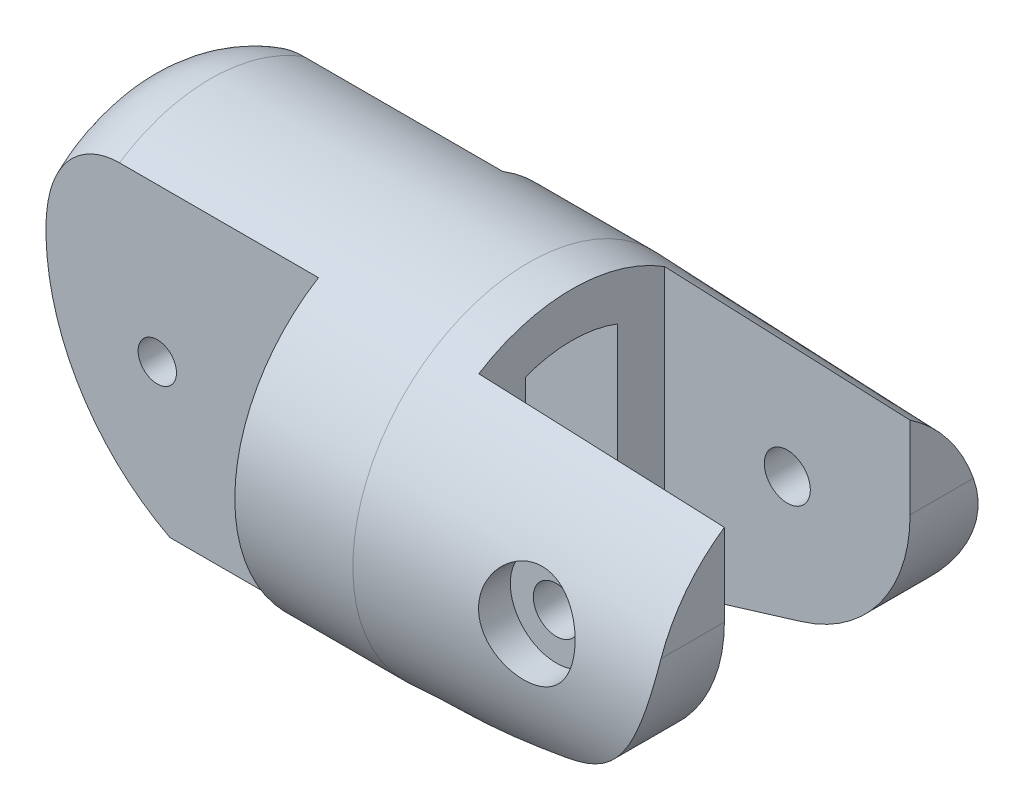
ISO-10303-21;
HEADER;
FILE_DESCRIPTION(('STEP AP214'),'2;1');
FILE_NAME('part.step','',(''),(''),'','','');
FILE_SCHEMA(('AUTOMOTIVE_DESIGN { 1 0 10303 214 1 1 1 1 }'));
ENDSEC;
DATA;
#1=APPLICATION_CONTEXT('core data for automotive mechanical design processes');
#2=APPLICATION_PROTOCOL_DEFINITION('international standard','automotive_design',2000,#1);
#3=PRODUCT_CONTEXT('',#1,'mechanical');
#4=PRODUCT('Part','Part','',(#3));
#5=PRODUCT_RELATED_PRODUCT_CATEGORY('part','',(#4));
#6=PRODUCT_DEFINITION_FORMATION('','',#4);
#7=PRODUCT_DEFINITION_CONTEXT('part definition',#1,'design');
#8=PRODUCT_DEFINITION('design','',#6,#7);
#9=PRODUCT_DEFINITION_SHAPE('','',#8);
#10=(LENGTH_UNIT() NAMED_UNIT(*) SI_UNIT(.MILLI.,.METRE.));
#11=(NAMED_UNIT(*) PLANE_ANGLE_UNIT() SI_UNIT($,.RADIAN.));
#12=(NAMED_UNIT(*) SI_UNIT($,.STERADIAN.) SOLID_ANGLE_UNIT());
#13=UNCERTAINTY_MEASURE_WITH_UNIT(LENGTH_MEASURE(1.E-05),#10,'distance_accuracy_value','');
#14=(GEOMETRIC_REPRESENTATION_CONTEXT(3) GLOBAL_UNCERTAINTY_ASSIGNED_CONTEXT((#13)) GLOBAL_UNIT_ASSIGNED_CONTEXT((#10,
#11,#12)) REPRESENTATION_CONTEXT('',''));
#15=CARTESIAN_POINT('',(0.,0.,0.));
#16=DIRECTION('',(0.,0.,1.));
#17=DIRECTION('',(1.,0.,0.));
#18=AXIS2_PLACEMENT_3D('',#15,#16,#17);
#19=CARTESIAN_POINT('',(-25.,11.45,-11.45));
#20=DIRECTION('',(0.996194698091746,0.0871557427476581,0.));
#21=DIRECTION('',(-0.0871557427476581,0.996194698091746,0.));
#22=AXIS2_PLACEMENT_3D('',#19,#20,#21);
#23=PLANE('',#22);
#24=DIRECTION('',(0.,0.,1.));
#25=VECTOR('',#24,1.);
#26=CARTESIAN_POINT('',(-24.1944624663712,2.24266385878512,-11.45));
#27=LINE('',#26,#25);
#28=CARTESIAN_POINT('',(-24.1944624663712,2.24266385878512,2.99999999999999));
#29=VERTEX_POINT('',#28);
#30=CARTESIAN_POINT('',(-24.1944624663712,2.24266385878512,5.86757576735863));
#31=VERTEX_POINT('',#30);
#32=EDGE_CURVE('E248',#29,#31,#27,.T.);
#33=ORIENTED_EDGE('',*,*,#32,.T.);
#34=CARTESIAN_POINT('',(-23.9601291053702,-0.43577871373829,0.));
#35=DIRECTION('',(0.996194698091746,0.0871557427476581,0.));
#36=DIRECTION('',(-0.0871557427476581,0.996194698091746,0.));
#37=AXIS2_PLACEMENT_3D('',#34,#35,#36);
#38=ELLIPSE('',#37,6.47463795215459,6.45);
#39=CARTESIAN_POINT('',(-24.4596771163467,5.27408117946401,2.99999999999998));
#40=VERTEX_POINT('',#39);
#41=EDGE_CURVE('E450',#31,#40,#38,.F.);
#42=ORIENTED_EDGE('',*,*,#41,.T.);
#43=DIRECTION('',(0.0871557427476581,-0.996194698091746,0.));
#44=VECTOR('',#43,1.);
#45=CARTESIAN_POINT('',(-25.,11.45,2.99999999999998));
#46=LINE('',#45,#44);
#47=EDGE_CURVE('E249',#40,#29,#46,.T.);
#48=ORIENTED_EDGE('',*,*,#47,.T.);
#49=EDGE_LOOP('',(#33,#42,#48));
#50=FACE_BOUND('',#49,.T.);
#51=ADVANCED_FACE('F35',(#50),#23,.F.);
#52=CARTESIAN_POINT('',(-17.,-0.247948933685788,-11.45));
#53=DIRECTION('',(0.,0.,1.));
#54=DIRECTION('',(1.,0.,0.));
#55=AXIS2_PLACEMENT_3D('',#52,#53,#54);
#56=CYLINDRICAL_SURFACE('',#55,1.25);
#57=CARTESIAN_POINT('',(-17.,-0.247948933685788,-3.));
#58=DIRECTION('',(0.,0.,-1.));
#59=DIRECTION('',(0.,1.,0.));
#60=AXIS2_PLACEMENT_3D('',#57,#58,#59);
#61=CIRCLE('',#60,1.25);
#62=CARTESIAN_POINT('',(-17.,1.00205106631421,-3.));
#63=VERTEX_POINT('',#62);
#64=EDGE_CURVE('E251',#63,#63,#61,.F.);
#65=ORIENTED_EDGE('',*,*,#64,.T.);
#66=EDGE_LOOP('',(#65));
#67=FACE_BOUND('',#66,.T.);
#68=CARTESIAN_POINT('',(-17.,-0.247948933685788,-6.));
#69=DIRECTION('',(0.,0.,1.));
#70=DIRECTION('',(1.,0.,0.));
#71=AXIS2_PLACEMENT_3D('',#68,#69,#70);
#72=CIRCLE('',#71,1.25);
#73=CARTESIAN_POINT('',(-15.75,-0.247948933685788,-6.));
#74=VERTEX_POINT('',#73);
#75=EDGE_CURVE('E623',#74,#74,#72,.T.);
#76=ORIENTED_EDGE('',*,*,#75,.F.);
#77=EDGE_LOOP('',(#76));
#78=FACE_BOUND('',#77,.T.);
#79=ADVANCED_FACE('F421',(#67,#78),#56,.F.);
#80=CARTESIAN_POINT('',(12.,1.7520510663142,-11.45));
#81=DIRECTION('',(0.,0.,1.));
#82=DIRECTION('',(1.,0.,0.));
#83=AXIS2_PLACEMENT_3D('',#80,#81,#82);
#84=CYLINDRICAL_SURFACE('',#83,1.5);
#85=CARTESIAN_POINT('',(12.,1.7520510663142,6.05));
#86=DIRECTION('',(0.,0.,1.));
#87=DIRECTION('',(1.,0.,0.));
#88=AXIS2_PLACEMENT_3D('',#85,#86,#87);
#89=CIRCLE('',#88,1.5);
#90=CARTESIAN_POINT('',(13.5,1.7520510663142,6.05));
#91=VERTEX_POINT('',#90);
#92=EDGE_CURVE('E627',#91,#91,#89,.T.);
#93=ORIENTED_EDGE('',*,*,#92,.F.);
#94=EDGE_LOOP('',(#93));
#95=FACE_BOUND('',#94,.T.);
#96=CARTESIAN_POINT('',(12.,1.7520510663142,9.));
#97=DIRECTION('',(0.,0.,1.));
#98=DIRECTION('',(1.,0.,0.));
#99=AXIS2_PLACEMENT_3D('',#96,#97,#98);
#100=CIRCLE('',#99,1.5);
#101=CARTESIAN_POINT('',(13.5,1.7520510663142,9.));
#102=VERTEX_POINT('',#101);
#103=EDGE_CURVE('E309',#102,#102,#100,.F.);
#104=ORIENTED_EDGE('',*,*,#103,.F.);
#105=EDGE_LOOP('',(#104));
#106=FACE_BOUND('',#105,.T.);
#107=ADVANCED_FACE('F337',(#95,#106),#84,.F.);
#108=CARTESIAN_POINT('',(1.19109025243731,0.,0.));
#109=DIRECTION('',(-1.,0.,0.));
#110=DIRECTION('',(0.,0.,1.));
#111=AXIS2_PLACEMENT_3D('',#108,#109,#110);
#112=CONICAL_SURFACE('',#111,11.4500000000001,0.0349065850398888);
#113=CARTESIAN_POINT('',(7.39359152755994,-0.22648244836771,0.));
#114=DIRECTION('',(-0.866025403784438,0.5,0.));
#115=DIRECTION('',(-0.5,-0.866025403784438,0.));
#116=AXIS2_PLACEMENT_3D('',#113,#114,#115);
#117=ELLIPSE('',#116,12.9712175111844,11.2311205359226);
#118=CARTESIAN_POINT('',(8.53589838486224,1.7520510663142,-11.0555445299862));
#119=VERTEX_POINT('',#118);
#120=CARTESIAN_POINT('',(10.2679491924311,4.75205106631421,-10.067886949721));
#121=VERTEX_POINT('',#120);
#122=EDGE_CURVE('E235',#119,#121,#117,.F.);
#123=ORIENTED_EDGE('',*,*,#122,.F.);
#124=CARTESIAN_POINT('',(9.41750853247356,0.225057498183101,0.));
#125=DIRECTION('',(-0.866025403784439,-0.5,0.));
#126=DIRECTION('',(-0.5,0.866025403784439,0.));
#127=AXIS2_PLACEMENT_3D('',#124,#125,#126);
#128=ELLIPSE('',#127,12.8896070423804,11.1604581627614);
#129=CARTESIAN_POINT('',(10.2679491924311,-1.24794893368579,-11.0628640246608));
#130=VERTEX_POINT('',#129);
#131=EDGE_CURVE('E385',#130,#119,#128,.F.);
#132=ORIENTED_EDGE('',*,*,#131,.F.);
#133=CARTESIAN_POINT('',(18.8361083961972,-1.2479489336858,-10.7617066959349));
#134=CARTESIAN_POINT('',(16.1268527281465,-1.2479489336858,-10.8569491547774));
#135=CARTESIAN_POINT('',(13.4175965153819,-1.24794893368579,-10.9521761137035));
#136=CARTESIAN_POINT('',(7.99908300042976,-1.24794893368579,-11.1425990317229));
#137=CARTESIAN_POINT('',(5.28982569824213,-1.24794893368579,-11.2377949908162));
#138=CARTESIAN_POINT('',(2.58056785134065,-1.24794893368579,-11.3329754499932));
#139=B_SPLINE_CURVE_WITH_KNOTS('',3,(#133,#134,#135,#136,#137,#138),.UNSPECIFIED.,.F.,.F.,(4,2,
4),(0.,8.13278775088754,16.2655755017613),.UNSPECIFIED.);
#140=CARTESIAN_POINT('',(13.7320508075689,-1.24794893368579,-10.9411191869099));
#141=VERTEX_POINT('',#140);
#142=EDGE_CURVE('E376',#141,#130,#139,.T.);
#143=ORIENTED_EDGE('',*,*,#142,.F.);
#144=CARTESIAN_POINT('',(14.3246121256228,-0.221602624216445,0.));
#145=DIRECTION('',(0.866025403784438,-0.5,0.));
#146=DIRECTION('',(-0.5,-0.866025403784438,0.));
#147=AXIS2_PLACEMENT_3D('',#144,#145,#146);
#148=ELLIPSE('',#147,12.6917377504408,10.9891331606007);
#149=CARTESIAN_POINT('',(15.4641016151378,1.75205106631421,-10.8105190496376));
#150=VERTEX_POINT('',#149);
#151=EDGE_CURVE('E384',#150,#141,#148,.F.);
#152=ORIENTED_EDGE('',*,*,#151,.F.);
#153=CARTESIAN_POINT('',(16.3485291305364,0.220177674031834,0.));
#154=DIRECTION('',(0.866025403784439,0.5,0.));
#155=DIRECTION('',(-0.5,0.866025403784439,0.));
#156=AXIS2_PLACEMENT_3D('',#153,#154,#155);
#157=ELLIPSE('',#156,12.6101272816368,10.9184707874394);
#158=CARTESIAN_POINT('',(13.7320508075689,4.75205106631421,-9.93395572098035));
#159=VERTEX_POINT('',#158);
#160=EDGE_CURVE('E489',#159,#150,#157,.F.);
#161=ORIENTED_EDGE('',*,*,#160,.F.);
#162=CARTESIAN_POINT('',(2.59126262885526,4.75205106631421,-10.3635516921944));
#163=CARTESIAN_POINT('',(5.30019437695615,4.75205106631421,-10.2595010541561));
#164=CARTESIAN_POINT('',(8.00911459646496,4.75205106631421,-10.1551519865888));
#165=CARTESIAN_POINT('',(13.4269319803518,4.75205106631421,-9.94585699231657));
#166=CARTESIAN_POINT('',(16.1358291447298,4.75205106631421,-9.84091106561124));
#167=CARTESIAN_POINT('',(18.8447147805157,4.75205106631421,-9.73566670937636));
#168=B_SPLINE_CURVE_WITH_KNOTS('',3,(#162,#163,#164,#165,#166,#167),.UNSPECIFIED.,.F.,.F.,(4,2,
4),(0.,8.13278779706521,16.2655756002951),.UNSPECIFIED.);
#169=EDGE_CURVE('E484',#121,#159,#168,.T.);
#170=ORIENTED_EDGE('',*,*,#169,.F.);
#171=EDGE_LOOP('',(#123,#132,#143,#152,#161,#170));
#172=FACE_BOUND('',#171,.T.);
#173=CARTESIAN_POINT('',(28.5302298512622,-1.19877997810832,0.));
#174=DIRECTION('',(-0.292371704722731,0.956304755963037,0.));
#175=DIRECTION('',(-0.956304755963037,-0.292371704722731,0.));
#176=AXIS2_PLACEMENT_3D('',#173,#174,#175);
#177=ELLIPSE('',#176,35.8970996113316,10.4266087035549);
#178=CARTESIAN_POINT('',(12.9237170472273,-5.97016977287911,-9.28681991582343));
#179=VERTEX_POINT('',#178);
#180=CARTESIAN_POINT('',(1.19109025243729,-9.55719375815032,-6.30575510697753));
#181=VERTEX_POINT('',#180);
#182=EDGE_CURVE('E630',#179,#181,#177,.T.);
#183=ORIENTED_EDGE('',*,*,#182,.T.);
#184=CARTESIAN_POINT('',(1.19109025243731,0.,0.));
#185=DIRECTION('',(-1.,0.,0.));
#186=DIRECTION('',(0.,0.,1.));
#187=AXIS2_PLACEMENT_3D('',#184,#185,#186);
#188=CIRCLE('',#187,11.4500000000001);
#189=CARTESIAN_POINT('',(1.19109025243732,-9.55719375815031,6.30575510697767));
#190=VERTEX_POINT('',#189);
#191=EDGE_CURVE('E315',#190,#181,#188,.T.);
#192=ORIENTED_EDGE('',*,*,#191,.F.);
#193=CARTESIAN_POINT('',(12.9237170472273,-5.97016977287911,9.28681991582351));
#194=VERTEX_POINT('',#193);
#195=EDGE_CURVE('E325',#190,#194,#177,.T.);
#196=ORIENTED_EDGE('',*,*,#195,.T.);
#197=CARTESIAN_POINT('',(12.9235170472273,-5.97023091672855,9.28678891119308));
#198=CARTESIAN_POINT('',(13.1963528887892,-5.88679912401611,9.32905353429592));
#199=CARTESIAN_POINT('',(13.4644475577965,-5.79209295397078,9.37745471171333));
#200=CARTESIAN_POINT('',(13.9899025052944,-5.58104866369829,9.48331175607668));
#201=CARTESIAN_POINT('',(14.2472709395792,-5.46472736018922,9.54076057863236));
#202=CARTESIAN_POINT('',(15.0028989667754,-5.08405796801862,9.72218174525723));
#203=CARTESIAN_POINT('',(15.4837385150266,-4.78829613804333,9.85506210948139));
#204=CARTESIAN_POINT('',(16.1620315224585,-4.28801199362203,10.0523087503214));
#205=CARTESIAN_POINT('',(16.3809065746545,-4.11187412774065,10.1176919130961));
#206=CARTESIAN_POINT('',(16.8037450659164,-3.74115220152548,10.2448326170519));
#207=CARTESIAN_POINT('',(17.0077086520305,-3.54656832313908,10.3065901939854));
#208=CARTESIAN_POINT('',(17.3990425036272,-3.14014961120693,10.4233222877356));
#209=CARTESIAN_POINT('',(17.5864393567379,-2.92834350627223,10.4783077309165));
#210=CARTESIAN_POINT('',(17.9435885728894,-2.48821152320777,10.5786420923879));
#211=CARTESIAN_POINT('',(18.11334505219,-2.25988952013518,10.6239932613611));
#212=CARTESIAN_POINT('',(18.4018744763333,-1.83490042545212,10.6944091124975));
#213=CARTESIAN_POINT('',(18.5240835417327,-1.64092939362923,10.7217130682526));
#214=CARTESIAN_POINT('',(18.7552917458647,-1.24422311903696,10.7668280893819));
#215=CARTESIAN_POINT('',(18.8642934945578,-1.04148961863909,10.7846410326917));
#216=CARTESIAN_POINT('',(19.0682631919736,-0.628454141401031,10.8094375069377));
#217=CARTESIAN_POINT('',(19.1632329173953,-0.418153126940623,10.8164224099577));
#218=CARTESIAN_POINT('',(19.338414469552,0.0085782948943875,10.8183814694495));
#219=CARTESIAN_POINT('',(19.4186266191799,0.22500856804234,10.8133558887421));
#220=CARTESIAN_POINT('',(19.5640975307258,0.663431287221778,10.7902643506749));
#221=CARTESIAN_POINT('',(19.6292759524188,0.885446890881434,10.7721303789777));
#222=CARTESIAN_POINT('',(19.7438045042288,1.33203397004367,10.7220366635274));
#223=CARTESIAN_POINT('',(19.7931522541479,1.55660582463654,10.6900748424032));
#224=CARTESIAN_POINT('',(19.8759030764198,2.00585532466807,10.6120082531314));
#225=CARTESIAN_POINT('',(19.9093301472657,2.23053229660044,10.5659249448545));
#226=CARTESIAN_POINT('',(19.96062425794,2.67818309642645,10.4595689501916));
#227=CARTESIAN_POINT('',(19.978501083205,2.90115790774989,10.3993052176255));
#228=CARTESIAN_POINT('',(19.9926452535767,3.20131999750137,10.3080859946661));
#229=CARTESIAN_POINT('',(19.9954169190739,3.28011948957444,10.2831809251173));
#230=CARTESIAN_POINT('',(19.999093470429,3.43706984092,10.2316537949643));
#231=CARTESIAN_POINT('',(20.0000011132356,3.51522148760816,10.2050343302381));
#232=CARTESIAN_POINT('',(19.999999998,3.59307778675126,10.1775484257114));
#233=B_SPLINE_CURVE_WITH_KNOTS('',3,(#197,#198,#199,#200,#201,#202,#203,#204,#205,#206,#207,
#208,#209,#210,#211,#212,#213,#214,#215,#216,#217,#218,#219,#220,#221,#222,#223,#224,#225,#226,
#227,#228,#229,#230,#231,#232),.UNSPECIFIED.,.F.,.F.,(4,2,2,2,2,2,2,2,2,2,2,2,2,2,2,2,2,4),(0.,
0.864373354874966,1.72807701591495,3.4584482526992,4.32309476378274,5.18773274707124,
6.05095689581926,6.91397916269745,7.60593816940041,8.29776021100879,8.9894945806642,
9.68121381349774,10.3765481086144,11.0719869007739,11.7663740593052,12.460323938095,
12.7083573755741,12.9560236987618),.UNSPECIFIED.);
#234=CARTESIAN_POINT('',(20.,3.59287778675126,10.1776190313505));
#235=VERTEX_POINT('',#234);
#236=EDGE_CURVE('E318',#194,#235,#233,.T.);
#237=ORIENTED_EDGE('',*,*,#236,.T.);
#238=CARTESIAN_POINT('',(20.,0.,0.));
#239=DIRECTION('',(1.,0.,0.));
#240=DIRECTION('',(0.,0.,-1.));
#241=AXIS2_PLACEMENT_3D('',#238,#239,#240);
#242=CIRCLE('',#241,10.7931783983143);
#243=CARTESIAN_POINT('',(20.,8.93813179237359,6.05));
#244=VERTEX_POINT('',#243);
#245=EDGE_CURVE('E933',#244,#235,#242,.T.);
#246=ORIENTED_EDGE('',*,*,#245,.F.);
#247=CARTESIAN_POINT('',(27.8719974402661,8.60417109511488,6.05));
#248=CARTESIAN_POINT('',(24.2424924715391,8.75909873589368,6.05));
#249=CARTESIAN_POINT('',(20.6129299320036,8.91267189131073,6.05));
#250=CARTESIAN_POINT('',(13.3537064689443,9.21744768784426,6.05));
#251=CARTESIAN_POINT('',(9.72404554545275,9.36865032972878,6.05));
#252=CARTESIAN_POINT('',(2.46464002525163,9.66902364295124,6.05));
#253=CARTESIAN_POINT('',(-1.16510457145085,9.81819431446,6.05));
#254=CARTESIAN_POINT('',(-8.42466779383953,10.114752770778,6.05));
#255=CARTESIAN_POINT('',(-12.0544864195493,10.2621405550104,6.05));
#256=CARTESIAN_POINT('',(-15.6843359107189,10.4087613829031,6.05));
#257=B_SPLINE_CURVE_WITH_KNOTS('',3,(#247,#248,#249,#250,#251,#252,#253,#254,#255,#256),
.UNSPECIFIED.,.F.,.F.,(4,2,2,2,4),(0.,10.8984295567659,21.7968555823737,32.6952806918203,
43.5937093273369),.UNSPECIFIED.);
#258=CARTESIAN_POINT('',(4.,9.60538269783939,6.05));
#259=VERTEX_POINT('',#258);
#260=EDGE_CURVE('E355',#244,#259,#257,.T.);
#261=ORIENTED_EDGE('',*,*,#260,.T.);
#262=CARTESIAN_POINT('',(4.,0.,0.));
#263=DIRECTION('',(-1.,0.,0.));
#264=DIRECTION('',(0.,0.,1.));
#265=AXIS2_PLACEMENT_3D('',#262,#263,#264);
#266=CIRCLE('',#265,11.3519107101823);
#267=CARTESIAN_POINT('',(4.,9.60538269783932,-6.05));
#268=VERTEX_POINT('',#267);
#269=EDGE_CURVE('E932',#259,#268,#266,.T.);
#270=ORIENTED_EDGE('',*,*,#269,.T.);
#271=CARTESIAN_POINT('',(-15.6843359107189,10.408761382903,-6.04999999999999));
#272=CARTESIAN_POINT('',(-12.0544864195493,10.2621405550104,-6.04999999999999));
#273=CARTESIAN_POINT('',(-8.42466779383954,10.114752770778,-6.04999999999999));
#274=CARTESIAN_POINT('',(-1.16510457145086,9.81819431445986,-6.05));
#275=CARTESIAN_POINT('',(2.46464002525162,9.66902364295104,-6.05));
#276=CARTESIAN_POINT('',(9.72404554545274,9.36865032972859,-6.05));
#277=CARTESIAN_POINT('',(13.3537064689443,9.21744768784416,-6.05));
#278=CARTESIAN_POINT('',(20.6129299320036,8.91267189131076,-6.05));
#279=CARTESIAN_POINT('',(24.2424924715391,8.75909873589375,-6.05));
#280=CARTESIAN_POINT('',(27.8719974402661,8.60417109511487,-6.05));
#281=B_SPLINE_CURVE_WITH_KNOTS('',3,(#271,#272,#273,#274,#275,#276,#277,#278,#279,#280),
.UNSPECIFIED.,.F.,.F.,(4,2,2,2,4),(0.,10.8984286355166,21.7968537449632,32.6952797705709,
43.5937093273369),.UNSPECIFIED.);
#282=CARTESIAN_POINT('',(20.,8.93813179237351,-6.05));
#283=VERTEX_POINT('',#282);
#284=EDGE_CURVE('E363',#268,#283,#281,.T.);
#285=ORIENTED_EDGE('',*,*,#284,.T.);
#286=CARTESIAN_POINT('',(20.,0.,0.));
#287=DIRECTION('',(1.,0.,0.));
#288=DIRECTION('',(0.,0.,-1.));
#289=AXIS2_PLACEMENT_3D('',#286,#287,#288);
#290=CIRCLE('',#289,10.7931783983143);
#291=CARTESIAN_POINT('',(20.,3.59287778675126,-10.1776190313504));
#292=VERTEX_POINT('',#291);
#293=EDGE_CURVE('E931',#292,#283,#290,.T.);
#294=ORIENTED_EDGE('',*,*,#293,.F.);
#295=CARTESIAN_POINT('',(19.999999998,3.59307778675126,-10.1775484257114));
#296=CARTESIAN_POINT('',(20.0000028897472,3.48853140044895,-10.2144585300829));
#297=CARTESIAN_POINT('',(19.9983642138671,3.38344555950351,-10.2498052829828));
#298=CARTESIAN_POINT('',(19.9917124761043,3.17236245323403,-10.317332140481));
#299=CARTESIAN_POINT('',(19.9866992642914,3.06636514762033,-10.3495121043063));
#300=CARTESIAN_POINT('',(19.9664639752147,2.7473158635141,-10.4412243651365));
#301=CARTESIAN_POINT('',(19.9460463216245,2.5331625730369,-10.4959445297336));
#302=CARTESIAN_POINT('',(19.8909958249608,2.10469983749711,-10.5921266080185));
#303=CARTESIAN_POINT('',(19.8564234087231,1.89039487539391,-10.6336435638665));
#304=CARTESIAN_POINT('',(19.7728713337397,1.46250433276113,-10.7038332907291));
#305=CARTESIAN_POINT('',(19.7238929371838,1.24891869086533,-10.7325071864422));
#306=CARTESIAN_POINT('',(19.6115455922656,0.824027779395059,-10.7774007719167));
#307=CARTESIAN_POINT('',(19.5481630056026,0.612724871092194,-10.7936085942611));
#308=CARTESIAN_POINT('',(19.407344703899,0.194259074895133,-10.8141587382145));
#309=CARTESIAN_POINT('',(19.3299078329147,-0.0129034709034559,-10.8185000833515));
#310=CARTESIAN_POINT('',(19.1614830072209,-0.421607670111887,-10.8161755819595));
#311=CARTESIAN_POINT('',(19.0704926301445,-0.623148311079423,-10.8095077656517));
#312=CARTESIAN_POINT('',(18.8756248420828,-1.01928209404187,-10.7862059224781));
#313=CARTESIAN_POINT('',(18.7717473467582,-1.21387519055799,-10.7695718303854));
#314=CARTESIAN_POINT('',(18.5499943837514,-1.59823283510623,-10.7271584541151));
#315=CARTESIAN_POINT('',(18.4319147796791,-1.7878631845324,-10.7012316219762));
#316=CARTESIAN_POINT('',(18.1839567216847,-2.15799452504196,-10.6416118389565));
#317=CARTESIAN_POINT('',(18.0540744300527,-2.33849251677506,-10.6079163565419));
#318=CARTESIAN_POINT('',(17.6476949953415,-2.86540457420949,-10.4971767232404));
#319=CARTESIAN_POINT('',(17.3545230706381,-3.19713711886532,-10.4104916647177));
#320=CARTESIAN_POINT('',(16.6765938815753,-3.86959695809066,-10.2069139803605));
#321=CARTESIAN_POINT('',(16.284736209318,-4.20231274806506,-10.087391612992));
#322=CARTESIAN_POINT('',(15.4552894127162,-4.80365176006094,-9.8474909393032));
#323=CARTESIAN_POINT('',(15.0177494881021,-5.07234293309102,-9.72711368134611));
#324=CARTESIAN_POINT('',(14.2995814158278,-5.4403733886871,-9.55267782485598));
#325=CARTESIAN_POINT('',(14.032178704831,-5.56291015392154,-9.4923254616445));
#326=CARTESIAN_POINT('',(13.4860422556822,-5.78444932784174,-9.38136131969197));
#327=CARTESIAN_POINT('',(13.2073143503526,-5.88346367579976,-9.33074460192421));
#328=CARTESIAN_POINT('',(12.9235170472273,-5.97023091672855,-9.28678891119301));
#329=B_SPLINE_CURVE_WITH_KNOTS('',3,(#295,#296,#297,#298,#299,#300,#301,#302,#303,#304,#305,
#306,#307,#308,#309,#310,#311,#312,#313,#314,#315,#316,#317,#318,#319,#320,#321,#322,#323,#324,
#325,#326,#327,#328),.UNSPECIFIED.,.F.,.F.,(4,2,2,2,2,2,2,2,2,2,2,2,2,2,2,2,4),(0.,
0.332562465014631,0.665139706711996,1.3301548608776,1.99236017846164,2.65450749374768,
3.31728438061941,3.98011580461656,4.64306583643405,5.30602020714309,5.98000442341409,
6.65420857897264,8.00296096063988,9.58039667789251,11.1561506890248,12.0557958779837,
12.9549834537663),.UNSPECIFIED.);
#330=EDGE_CURVE('E370',#292,#179,#329,.T.);
#331=ORIENTED_EDGE('',*,*,#330,.T.);
#332=EDGE_LOOP('',(#183,#192,#196,#237,#246,#261,#270,#285,#294,#331));
#333=FACE_BOUND('',#332,.T.);
#334=CARTESIAN_POINT('',(9.89095068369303,-0.38147086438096,11.1396636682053));
#335=CARTESIAN_POINT('',(9.7741919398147,-0.26604823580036,11.1476944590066));
#336=CARTESIAN_POINT('',(9.66684565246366,-0.140937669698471,11.1539250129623));
#337=CARTESIAN_POINT('',(9.47400003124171,0.125292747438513,11.1608440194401));
#338=CARTESIAN_POINT('',(9.38850333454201,0.266414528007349,11.1615318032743));
#339=CARTESIAN_POINT('',(9.24175274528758,0.56077702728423,11.155748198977));
#340=CARTESIAN_POINT('',(9.18051873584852,0.714027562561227,11.1492709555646));
#341=CARTESIAN_POINT('',(9.08407218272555,1.02795009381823,11.1280999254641));
#342=CARTESIAN_POINT('',(9.04885615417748,1.18862109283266,11.1134072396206));
#343=CARTESIAN_POINT('',(9.00540237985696,1.51039536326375,11.0757649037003));
#344=CARTESIAN_POINT('',(8.99681278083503,1.67146459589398,11.0529274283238));
#345=CARTESIAN_POINT('',(9.00529335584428,1.99160044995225,10.9994516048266));
#346=CARTESIAN_POINT('',(9.02236623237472,2.15066685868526,10.9688124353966));
#347=CARTESIAN_POINT('',(9.08166963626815,2.46591803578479,10.9001951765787));
#348=CARTESIAN_POINT('',(9.12441123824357,2.62197591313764,10.8620788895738));
#349=CARTESIAN_POINT('',(9.23374030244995,2.92407283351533,10.7807277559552));
#350=CARTESIAN_POINT('',(9.30033447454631,3.07010904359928,10.7374914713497));
#351=CARTESIAN_POINT('',(9.45994144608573,3.35724101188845,10.6454854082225));
#352=CARTESIAN_POINT('',(9.55427103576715,3.49754892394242,10.5965399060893));
#353=CARTESIAN_POINT('',(9.76504521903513,3.76037788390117,10.4983303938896));
#354=CARTESIAN_POINT('',(9.88149883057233,3.88289164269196,10.4490662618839));
#355=CARTESIAN_POINT('',(10.1391551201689,4.11173955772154,10.3515304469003));
#356=CARTESIAN_POINT('',(10.2811710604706,4.21721417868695,10.3033803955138));
#357=CARTESIAN_POINT('',(10.58318978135,4.40233193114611,10.2141758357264));
#358=CARTESIAN_POINT('',(10.7431878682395,4.48198178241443,10.1731194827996));
#359=CARTESIAN_POINT('',(11.0700492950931,4.6094385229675,10.1034442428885));
#360=CARTESIAN_POINT('',(11.2363529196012,4.65842877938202,10.0743802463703));
#361=CARTESIAN_POINT('',(11.5765714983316,4.72707213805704,10.0292276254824));
#362=CARTESIAN_POINT('',(11.7504797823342,4.74675043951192,10.0131278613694));
#363=CARTESIAN_POINT('',(12.0832669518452,4.75507006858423,9.99630875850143));
#364=CARTESIAN_POINT('',(12.242016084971,4.74646403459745,9.99428183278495));
#365=CARTESIAN_POINT('',(12.5558610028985,4.70435081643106,10.0020631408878));
#366=CARTESIAN_POINT('',(12.7109571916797,4.67084639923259,10.0118700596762));
#367=CARTESIAN_POINT('',(13.0080237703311,4.58174503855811,10.0415454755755));
#368=CARTESIAN_POINT('',(13.1502571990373,4.5269036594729,10.0610756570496));
#369=CARTESIAN_POINT('',(13.4237397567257,4.39702685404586,10.1080951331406));
#370=CARTESIAN_POINT('',(13.5549863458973,4.32198677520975,10.1355862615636));
#371=CARTESIAN_POINT('',(13.8115061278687,4.14868495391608,10.198123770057));
#372=CARTESIAN_POINT('',(13.9359181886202,4.04928057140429,10.2335303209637));
#373=CARTESIAN_POINT('',(14.1669771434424,3.83274914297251,10.3079734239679));
#374=CARTESIAN_POINT('',(14.2736168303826,3.71561494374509,10.3470114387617));
#375=CARTESIAN_POINT('',(14.4746496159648,3.45647253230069,10.4291728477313));
#376=CARTESIAN_POINT('',(14.5674299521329,3.31323480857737,10.4723767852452));
#377=CARTESIAN_POINT('',(14.7276030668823,3.01267974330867,10.5569460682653));
#378=CARTESIAN_POINT('',(14.7949921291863,2.85536034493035,10.5983111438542));
#379=CARTESIAN_POINT('',(14.9032275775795,2.5276512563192,10.6773704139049));
#380=CARTESIAN_POINT('',(14.9435825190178,2.35707937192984,10.7149865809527));
#381=CARTESIAN_POINT('',(14.9939991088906,2.01022866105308,10.7836468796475));
#382=CARTESIAN_POINT('',(15.0040691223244,1.83395142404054,10.8146928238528));
#383=CARTESIAN_POINT('',(14.9931711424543,1.48806195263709,10.8679613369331));
#384=CARTESIAN_POINT('',(14.9733979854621,1.31845782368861,10.8904807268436));
#385=CARTESIAN_POINT('',(14.9051030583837,0.98430110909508,10.9281454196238));
#386=CARTESIAN_POINT('',(14.8565866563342,0.819747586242,10.9432920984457));
#387=CARTESIAN_POINT('',(14.7340970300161,0.506216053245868,10.9664800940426));
#388=CARTESIAN_POINT('',(14.6610212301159,0.356902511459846,10.974740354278));
#389=CARTESIAN_POINT('',(14.4911295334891,0.0722455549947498,10.9862390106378));
#390=CARTESIAN_POINT('',(14.3943132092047,-0.0630976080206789,10.9894773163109));
#391=CARTESIAN_POINT('',(14.1794199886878,-0.316222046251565,10.992621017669));
#392=CARTESIAN_POINT('',(14.0612984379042,-0.433965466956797,10.9925193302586));
#393=CARTESIAN_POINT('',(13.8072084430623,-0.648287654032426,10.9908547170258));
#394=CARTESIAN_POINT('',(13.6712387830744,-0.744864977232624,10.989291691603));
#395=CARTESIAN_POINT('',(13.3833039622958,-0.915311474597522,10.9865101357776));
#396=CARTESIAN_POINT('',(13.2311521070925,-0.988865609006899,10.9852964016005));
#397=CARTESIAN_POINT('',(12.9166712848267,-1.10942948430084,10.9848157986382));
#398=CARTESIAN_POINT('',(12.7543426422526,-1.15644007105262,10.9855488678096));
#399=CARTESIAN_POINT('',(12.4241839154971,-1.22257560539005,10.9899871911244));
#400=CARTESIAN_POINT('',(12.2563553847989,-1.24170835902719,10.9936916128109));
#401=CARTESIAN_POINT('',(11.9199614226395,-1.25159831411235,11.0043931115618));
#402=CARTESIAN_POINT('',(11.7513959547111,-1.24235409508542,11.0113903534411));
#403=CARTESIAN_POINT('',(11.4188472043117,-1.19589211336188,11.0282128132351));
#404=CARTESIAN_POINT('',(11.2548515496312,-1.15875947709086,11.0380293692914));
#405=CARTESIAN_POINT('',(10.935474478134,-1.05772228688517,11.0593709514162));
#406=CARTESIAN_POINT('',(10.7800911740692,-0.993823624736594,11.0708956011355));
#407=CARTESIAN_POINT('',(10.4951183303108,-0.847700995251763,11.09297482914));
#408=CARTESIAN_POINT('',(10.364460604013,-0.767549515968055,11.1035267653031));
#409=CARTESIAN_POINT('',(10.1167932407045,-0.588227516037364,11.1231283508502));
#410=CARTESIAN_POINT('',(9.99978302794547,-0.489057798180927,11.1321780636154));
#411=CARTESIAN_POINT('',(9.89095068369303,-0.38147086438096,11.1396636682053));
#412=B_SPLINE_CURVE_WITH_KNOTS('',3,(#334,#335,#336,#337,#338,#339,#340,#341,#342,#343,#344,
#345,#346,#347,#348,#349,#350,#351,#352,#353,#354,#355,#356,#357,#358,#359,#360,#361,#362,#363,
#364,#365,#366,#367,#368,#369,#370,#371,#372,#373,#374,#375,#376,#377,#378,#379,#380,#381,#382,
#383,#384,#385,#386,#387,#388,#389,#390,#391,#392,#393,#394,#395,#396,#397,#398,#399,#400,#401,
#402,#403,#404,#405,#406,#407,#408,#409,#410,#411),.UNSPECIFIED.,.T.,.F.,(4,2,2,2,2,2,2,2,2,2,2,
2,2,2,2,2,2,2,2,2,2,2,2,2,2,2,2,2,2,2,2,2,2,2,2,2,2,2,4),(0.,0.49260077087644,0.985260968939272,
1.47832406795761,1.97132111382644,2.45777509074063,2.94428029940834,3.44080894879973,
3.93747738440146,4.46317966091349,4.98909667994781,5.5363799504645,6.08352069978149,
6.60797546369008,7.13197909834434,7.60655306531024,8.08107430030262,8.54013120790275,
8.9992939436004,9.48664035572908,9.97418392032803,10.4999031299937,11.0256992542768,
11.5608115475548,12.0957760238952,12.6098827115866,13.1238934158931,13.6208608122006,
14.1178371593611,14.615867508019,15.1139318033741,15.6185402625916,16.1231326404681,
16.6275837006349,17.1320600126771,17.6350026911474,18.1378347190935,18.5970136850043,
19.0561732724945),.UNSPECIFIED.);
#413=CARTESIAN_POINT('',(9.89095068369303,-0.38147086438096,11.1396636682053));
#414=VERTEX_POINT('',#413);
#415=EDGE_CURVE('E304',#414,#414,#412,.T.);
#416=ORIENTED_EDGE('',*,*,#415,.T.);
#417=EDGE_LOOP('',(#416));
#418=FACE_BOUND('',#417,.T.);
#419=ADVANCED_FACE('F331',(#172,#333,#418),#112,.T.);
#420=CARTESIAN_POINT('',(20.,0.,0.));
#421=DIRECTION('',(1.,0.,0.));
#422=DIRECTION('',(0.,0.,-1.));
#423=AXIS2_PLACEMENT_3D('',#420,#421,#422);
#424=PLANE('',#423);
#425=DIRECTION('',(0.,-1.,0.));
#426=VECTOR('',#425,1.);
#427=CARTESIAN_POINT('',(20.,0.,6.05));
#428=LINE('',#427,#426);
#429=CARTESIAN_POINT('',(20.,3.59287778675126,6.05));
#430=VERTEX_POINT('',#429);
#431=EDGE_CURVE('E606',#244,#430,#428,.T.);
#432=ORIENTED_EDGE('',*,*,#431,.F.);
#433=ORIENTED_EDGE('',*,*,#245,.T.);
#434=DIRECTION('',(0.,0.,1.));
#435=VECTOR('',#434,1.);
#436=CARTESIAN_POINT('',(20.,3.59287778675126,-11.45));
#437=LINE('',#436,#435);
#438=EDGE_CURVE('E904',#430,#235,#437,.T.);
#439=ORIENTED_EDGE('',*,*,#438,.F.);
#440=EDGE_LOOP('',(#432,#433,#439));
#441=FACE_BOUND('',#440,.T.);
#442=ADVANCED_FACE('F336',(#441),#424,.T.);
#443=CARTESIAN_POINT('',(20.,3.59287778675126,-6.05));
#444=VERTEX_POINT('',#443);
#445=EDGE_CURVE('E903',#292,#444,#437,.T.);
#446=ORIENTED_EDGE('',*,*,#445,.F.);
#447=ORIENTED_EDGE('',*,*,#293,.T.);
#448=DIRECTION('',(0.,1.,0.));
#449=VECTOR('',#448,1.);
#450=CARTESIAN_POINT('',(20.,0.,-6.05));
#451=LINE('',#450,#449);
#452=EDGE_CURVE('E601',#444,#283,#451,.T.);
#453=ORIENTED_EDGE('',*,*,#452,.F.);
#454=EDGE_LOOP('',(#446,#447,#453));
#455=FACE_BOUND('',#454,.T.);
#456=ADVANCED_FACE('F533',(#455),#424,.T.);
#457=CARTESIAN_POINT('',(20.,0.,0.));
#458=DIRECTION('',(-1.,0.,0.));
#459=DIRECTION('',(0.,0.,1.));
#460=AXIS2_PLACEMENT_3D('',#457,#458,#459);
#461=CYLINDRICAL_SURFACE('',#460,11.45);
#462=DIRECTION('',(-1.,0.,0.));
#463=VECTOR('',#462,1.);
#464=CARTESIAN_POINT('',(20.,9.75205106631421,-6.));
#465=LINE('',#464,#463);
#466=CARTESIAN_POINT('',(-6.5,9.75205106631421,-6.));
#467=VERTEX_POINT('',#466);
#468=CARTESIAN_POINT('',(-19.4597757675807,9.75205106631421,-6.));
#469=VERTEX_POINT('',#468);
#470=EDGE_CURVE('E594',#467,#469,#465,.T.);
#471=ORIENTED_EDGE('',*,*,#470,.T.);
#472=CARTESIAN_POINT('',(-18.9791556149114,0.,0.));
#473=DIRECTION('',(-0.998787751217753,-0.0492242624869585,0.));
#474=DIRECTION('',(-0.0492242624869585,0.998787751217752,0.));
#475=AXIS2_PLACEMENT_3D('',#472,#473,#474);
#476=ELLIPSE('',#475,11.4638970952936,11.45);
#477=CARTESIAN_POINT('',(-19.4597757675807,9.75205106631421,5.99999999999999));
#478=VERTEX_POINT('',#477);
#479=EDGE_CURVE('E234',#469,#478,#476,.F.);
#480=ORIENTED_EDGE('',*,*,#479,.T.);
#481=DIRECTION('',(-1.,0.,0.));
#482=VECTOR('',#481,1.);
#483=CARTESIAN_POINT('',(20.,9.75205106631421,5.99999999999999));
#484=LINE('',#483,#482);
#485=CARTESIAN_POINT('',(-6.5,9.75205106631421,6.));
#486=VERTEX_POINT('',#485);
#487=EDGE_CURVE('E585',#478,#486,#484,.F.);
#488=ORIENTED_EDGE('',*,*,#487,.T.);
#489=CARTESIAN_POINT('',(-6.5,0.,0.));
#490=DIRECTION('',(1.,0.,0.));
#491=DIRECTION('',(0.,0.,-1.));
#492=AXIS2_PLACEMENT_3D('',#489,#490,#491);
#493=CIRCLE('',#492,11.45);
#494=CARTESIAN_POINT('',(-6.5,-9.75205106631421,6.));
#495=VERTEX_POINT('',#494);
#496=EDGE_CURVE('E608',#486,#495,#493,.T.);
#497=ORIENTED_EDGE('',*,*,#496,.T.);
#498=DIRECTION('',(-1.,0.,0.));
#499=VECTOR('',#498,1.);
#500=CARTESIAN_POINT('',(20.,-9.75205106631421,5.99999999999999));
#501=LINE('',#500,#499);
#502=CARTESIAN_POINT('',(-16.1837449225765,-9.75205106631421,5.99999999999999));
#503=VERTEX_POINT('',#502);
#504=EDGE_CURVE('E589',#495,#503,#501,.T.);
#505=ORIENTED_EDGE('',*,*,#504,.T.);
#506=CARTESIAN_POINT('',(-24.1944624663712,2.24266385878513,11.2282215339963));
#507=CARTESIAN_POINT('',(-24.182569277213,2.10670241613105,11.255379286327));
#508=CARTESIAN_POINT('',(-24.1687742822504,1.97042587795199,11.2800281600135));
#509=CARTESIAN_POINT('',(-24.1373449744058,1.69750639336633,11.3243137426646));
#510=CARTESIAN_POINT('',(-24.1197107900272,1.56086345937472,11.3439506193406));
#511=CARTESIAN_POINT('',(-24.0610245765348,1.15097698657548,11.3953277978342));
#512=CARTESIAN_POINT('',(-24.0141707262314,0.877566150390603,11.4195763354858));
#513=CARTESIAN_POINT('',(-23.9055032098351,0.334799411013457,11.4483088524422));
#514=CARTESIAN_POINT('',(-23.8437998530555,0.065428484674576,11.4529340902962));
#515=CARTESIAN_POINT('',(-23.7056855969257,-0.469198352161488,11.4435060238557));
#516=CARTESIAN_POINT('',(-23.6292735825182,-0.734453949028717,11.4294513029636));
#517=CARTESIAN_POINT('',(-23.4626201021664,-1.25839821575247,11.3836708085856));
#518=CARTESIAN_POINT('',(-23.372407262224,-1.51709921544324,11.3519812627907));
#519=CARTESIAN_POINT('',(-23.1788877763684,-2.02704739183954,11.2720993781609));
#520=CARTESIAN_POINT('',(-23.075575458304,-2.27829128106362,11.2238998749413));
#521=CARTESIAN_POINT('',(-22.856745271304,-2.77230426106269,11.1122028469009));
#522=CARTESIAN_POINT('',(-22.7412110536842,-3.0150614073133,11.0486846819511));
#523=CARTESIAN_POINT('',(-22.4990993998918,-3.49084617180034,10.9077077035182));
#524=CARTESIAN_POINT('',(-22.3725195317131,-3.72387163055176,10.8302458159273));
#525=CARTESIAN_POINT('',(-22.060025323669,-4.2649573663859,10.6312751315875));
#526=CARTESIAN_POINT('',(-21.8696577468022,-4.56839519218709,10.5041405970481));
#527=CARTESIAN_POINT('',(-21.4726573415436,-5.15458309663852,10.2292550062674));
#528=CARTESIAN_POINT('',(-21.2660193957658,-5.43732661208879,10.0814974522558));
#529=CARTESIAN_POINT('',(-20.8385852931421,-5.98207459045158,9.76811907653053));
#530=CARTESIAN_POINT('',(-20.6177703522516,-6.24405046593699,9.60247434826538));
#531=CARTESIAN_POINT('',(-20.1643384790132,-6.74686917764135,9.25610478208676));
#532=CARTESIAN_POINT('',(-19.9317211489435,-6.98771130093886,9.07537943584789));
#533=CARTESIAN_POINT('',(-19.3648284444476,-7.53746084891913,8.62892746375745));
#534=CARTESIAN_POINT('',(-19.0259282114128,-7.83682341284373,8.35728698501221));
#535=CARTESIAN_POINT('',(-18.3328424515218,-8.39690925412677,7.79436691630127));
#536=CARTESIAN_POINT('',(-17.9786512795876,-8.6576181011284,7.50308005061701));
#537=CARTESIAN_POINT('',(-17.257612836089,-9.14219481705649,6.90444091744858));
#538=CARTESIAN_POINT('',(-16.8907447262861,-9.36599816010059,6.59706172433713));
#539=CARTESIAN_POINT('',(-16.1475762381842,-9.77760841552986,5.97005120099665));
#540=CARTESIAN_POINT('',(-15.7712762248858,-9.9654167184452,5.65042034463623));
#541=CARTESIAN_POINT('',(-14.896204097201,-10.357992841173,4.90331656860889));
#542=CARTESIAN_POINT('',(-14.3948488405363,-10.5506769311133,4.47249474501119));
#543=CARTESIAN_POINT('',(-13.3833582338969,-10.8795192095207,3.59947486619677));
#544=CARTESIAN_POINT('',(-12.8732191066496,-11.0156524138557,3.15727187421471));
#545=CARTESIAN_POINT('',(-11.8487025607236,-11.2327045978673,2.26680512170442));
#546=CARTESIAN_POINT('',(-11.3343372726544,-11.3137472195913,1.8185572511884));
#547=CARTESIAN_POINT('',(-10.3032405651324,-11.4220525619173,0.918851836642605));
#548=CARTESIAN_POINT('',(-9.78651109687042,-11.4493536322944,0.467396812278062));
#549=CARTESIAN_POINT('',(-9.26383947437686,-11.4499962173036,0.0107441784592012));
#550=CARTESIAN_POINT('',(-9.25769071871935,-11.4499999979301,0.00537207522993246));
#551=CARTESIAN_POINT('',(-9.25154199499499,-11.45,0.));
#552=B_SPLINE_CURVE_WITH_KNOTS('',3,(#506,#507,#508,#509,#510,#511,#512,#513,#514,#515,#516,
#517,#518,#519,#520,#521,#522,#523,#524,#525,#526,#527,#528,#529,#530,#531,#532,#533,#534,#535,
#536,#537,#538,#539,#540,#541,#542,#543,#544,#545,#546,#547,#548,#549,#550,#551),.UNSPECIFIED.,
.F.,.F.,(4,2,2,2,2,2,2,2,2,2,2,2,2,2,2,2,2,2,2,2,2,2,4),(0.,0.417394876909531,0.834775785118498,
1.66889650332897,2.49700249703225,3.32517129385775,4.15164500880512,4.97847782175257,
5.8064309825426,6.63456690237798,7.77318156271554,8.91215578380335,10.0526715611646,
11.1932257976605,12.7733902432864,14.3541431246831,15.93763115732,17.5210580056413,
19.583935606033,21.6477236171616,23.7068643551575,25.764535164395,25.7890300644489),.UNSPECIFIED.);
#553=CARTESIAN_POINT('',(-15.6856308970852,-10.,5.57696153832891));
#554=VERTEX_POINT('',#553);
#555=EDGE_CURVE('E547',#503,#554,#552,.T.);
#556=ORIENTED_EDGE('',*,*,#555,.T.);
#557=DIRECTION('',(-1.,0.,0.));
#558=VECTOR('',#557,1.);
#559=CARTESIAN_POINT('',(20.,-10.,5.57696153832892));
#560=LINE('',#559,#558);
#561=CARTESIAN_POINT('',(-0.257263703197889,-10.,5.57696153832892));
#562=VERTEX_POINT('',#561);
#563=EDGE_CURVE('E305',#554,#562,#560,.F.);
#564=ORIENTED_EDGE('',*,*,#563,.T.);
#565=CARTESIAN_POINT('',(32.4512624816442,0.,0.));
#566=DIRECTION('',(-0.292371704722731,0.956304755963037,0.));
#567=DIRECTION('',(-0.956304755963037,-0.292371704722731,0.));
#568=AXIS2_PLACEMENT_3D('',#565,#566,#567);
#569=ELLIPSE('',#568,39.1624764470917,11.45);
#570=EDGE_CURVE('E568',#562,#190,#569,.T.);
#571=ORIENTED_EDGE('',*,*,#570,.T.);
#572=ORIENTED_EDGE('',*,*,#191,.T.);
#573=CARTESIAN_POINT('',(-0.257263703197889,-10.,-5.57696153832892));
#574=VERTEX_POINT('',#573);
#575=EDGE_CURVE('E573',#181,#574,#569,.T.);
#576=ORIENTED_EDGE('',*,*,#575,.T.);
#577=DIRECTION('',(-1.,0.,0.));
#578=VECTOR('',#577,1.);
#579=CARTESIAN_POINT('',(20.,-10.,-5.57696153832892));
#580=LINE('',#579,#578);
#581=CARTESIAN_POINT('',(-15.6856308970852,-10.,-5.57696153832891));
#582=VERTEX_POINT('',#581);
#583=EDGE_CURVE('E308',#574,#582,#580,.T.);
#584=ORIENTED_EDGE('',*,*,#583,.T.);
#585=CARTESIAN_POINT('',(-24.1944624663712,2.24266385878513,-11.2282215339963));
#586=CARTESIAN_POINT('',(-24.182569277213,2.10670241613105,-11.255379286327));
#587=CARTESIAN_POINT('',(-24.1687742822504,1.97042587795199,-11.2800281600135));
#588=CARTESIAN_POINT('',(-24.1373449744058,1.69750639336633,-11.3243137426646));
#589=CARTESIAN_POINT('',(-24.1197107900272,1.56086345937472,-11.3439506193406));
#590=CARTESIAN_POINT('',(-24.0610245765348,1.15097698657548,-11.3953277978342));
#591=CARTESIAN_POINT('',(-24.0141707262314,0.877566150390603,-11.4195763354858));
#592=CARTESIAN_POINT('',(-23.9055032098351,0.334799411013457,-11.4483088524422));
#593=CARTESIAN_POINT('',(-23.8437998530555,0.065428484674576,-11.4529340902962));
#594=CARTESIAN_POINT('',(-23.7056855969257,-0.469198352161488,-11.4435060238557));
#595=CARTESIAN_POINT('',(-23.6292735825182,-0.734453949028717,-11.4294513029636));
#596=CARTESIAN_POINT('',(-23.4626201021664,-1.25839821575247,-11.3836708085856));
#597=CARTESIAN_POINT('',(-23.372407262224,-1.51709921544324,-11.3519812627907));
#598=CARTESIAN_POINT('',(-23.1788877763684,-2.02704739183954,-11.2720993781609));
#599=CARTESIAN_POINT('',(-23.075575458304,-2.27829128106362,-11.2238998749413));
#600=CARTESIAN_POINT('',(-22.856745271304,-2.77230426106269,-11.1122028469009));
#601=CARTESIAN_POINT('',(-22.7412110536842,-3.0150614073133,-11.0486846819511));
#602=CARTESIAN_POINT('',(-22.4990993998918,-3.49084617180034,-10.9077077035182));
#603=CARTESIAN_POINT('',(-22.3725195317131,-3.72387163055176,-10.8302458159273));
#604=CARTESIAN_POINT('',(-22.060025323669,-4.2649573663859,-10.6312751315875));
#605=CARTESIAN_POINT('',(-21.8696577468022,-4.56839519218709,-10.5041405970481));
#606=CARTESIAN_POINT('',(-21.4726573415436,-5.15458309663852,-10.2292550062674));
#607=CARTESIAN_POINT('',(-21.2660193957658,-5.43732661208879,-10.0814974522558));
#608=CARTESIAN_POINT('',(-20.8385852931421,-5.98207459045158,-9.76811907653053));
#609=CARTESIAN_POINT('',(-20.6177703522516,-6.24405046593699,-9.60247434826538));
#610=CARTESIAN_POINT('',(-20.1643384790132,-6.74686917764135,-9.25610478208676));
#611=CARTESIAN_POINT('',(-19.9317211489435,-6.98771130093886,-9.07537943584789));
#612=CARTESIAN_POINT('',(-19.3648284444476,-7.53746084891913,-8.62892746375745));
#613=CARTESIAN_POINT('',(-19.0259282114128,-7.83682341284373,-8.35728698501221));
#614=CARTESIAN_POINT('',(-18.3328424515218,-8.39690925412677,-7.79436691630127));
#615=CARTESIAN_POINT('',(-17.9786512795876,-8.6576181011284,-7.50308005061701));
#616=CARTESIAN_POINT('',(-17.257612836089,-9.14219481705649,-6.90444091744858));
#617=CARTESIAN_POINT('',(-16.8907447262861,-9.36599816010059,-6.59706172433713));
#618=CARTESIAN_POINT('',(-16.1475762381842,-9.77760841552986,-5.97005120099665));
#619=CARTESIAN_POINT('',(-15.7712762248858,-9.9654167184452,-5.65042034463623));
#620=CARTESIAN_POINT('',(-14.896204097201,-10.357992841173,-4.90331656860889));
#621=CARTESIAN_POINT('',(-14.3948488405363,-10.5506769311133,-4.47249474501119));
#622=CARTESIAN_POINT('',(-13.3833582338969,-10.8795192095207,-3.59947486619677));
#623=CARTESIAN_POINT('',(-12.8732191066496,-11.0156524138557,-3.15727187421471));
#624=CARTESIAN_POINT('',(-11.8487025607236,-11.2327045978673,-2.26680512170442));
#625=CARTESIAN_POINT('',(-11.3343372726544,-11.3137472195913,-1.8185572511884));
#626=CARTESIAN_POINT('',(-10.3032405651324,-11.4220525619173,-0.918851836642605));
#627=CARTESIAN_POINT('',(-9.78651109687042,-11.4493536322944,-0.467396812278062));
#628=CARTESIAN_POINT('',(-9.26383947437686,-11.4499962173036,-0.0107441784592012));
#629=CARTESIAN_POINT('',(-9.25769071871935,-11.4499999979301,-0.00537207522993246));
#630=CARTESIAN_POINT('',(-9.25154199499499,-11.45,0.));
#631=B_SPLINE_CURVE_WITH_KNOTS('',3,(#585,#586,#587,#588,#589,#590,#591,#592,#593,#594,#595,
#596,#597,#598,#599,#600,#601,#602,#603,#604,#605,#606,#607,#608,#609,#610,#611,#612,#613,#614,
#615,#616,#617,#618,#619,#620,#621,#622,#623,#624,#625,#626,#627,#628,#629,#630),.UNSPECIFIED.,
.F.,.F.,(4,2,2,2,2,2,2,2,2,2,2,2,2,2,2,2,2,2,2,2,2,2,4),(0.,0.417394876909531,0.834775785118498,
1.66889650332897,2.49700249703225,3.32517129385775,4.15164500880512,4.97847782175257,
5.8064309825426,6.63456690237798,7.77318156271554,8.91215578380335,10.0526715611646,
11.1932257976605,12.7733902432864,14.3541431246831,15.93763115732,17.5210580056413,
19.583935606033,21.6477236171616,23.7068643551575,25.764535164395,25.7890300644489),.UNSPECIFIED.);
#632=CARTESIAN_POINT('',(-16.1837449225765,-9.75205106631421,-6.));
#633=VERTEX_POINT('',#632);
#634=EDGE_CURVE('E541',#582,#633,#631,.F.);
#635=ORIENTED_EDGE('',*,*,#634,.T.);
#636=DIRECTION('',(-1.,0.,0.));
#637=VECTOR('',#636,1.);
#638=CARTESIAN_POINT('',(20.,-9.75205106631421,-6.));
#639=LINE('',#638,#637);
#640=CARTESIAN_POINT('',(-6.5,-9.75205106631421,-6.));
#641=VERTEX_POINT('',#640);
#642=EDGE_CURVE('E592',#633,#641,#639,.F.);
#643=ORIENTED_EDGE('',*,*,#642,.T.);
#644=CARTESIAN_POINT('',(-6.5,0.,0.));
#645=DIRECTION('',(1.,0.,0.));
#646=DIRECTION('',(0.,0.,-1.));
#647=AXIS2_PLACEMENT_3D('',#644,#645,#646);
#648=CIRCLE('',#647,11.45);
#649=EDGE_CURVE('E611',#641,#467,#648,.T.);
#650=ORIENTED_EDGE('',*,*,#649,.T.);
#651=EDGE_LOOP('',(#471,#480,#488,#497,#505,#556,#564,#571,#572,#576,#584,#635,#643,#650));
#652=FACE_BOUND('',#651,.T.);
#653=ADVANCED_FACE('F525',(#652),#461,.T.);
#654=CARTESIAN_POINT('',(4.,-11.45,-6.05));
#655=DIRECTION('',(-1.,0.,0.));
#656=DIRECTION('',(0.,0.,1.));
#657=AXIS2_PLACEMENT_3D('',#654,#655,#656);
#658=PLANE('',#657);
#659=DIRECTION('',(0.,1.,0.));
#660=VECTOR('',#659,1.);
#661=CARTESIAN_POINT('',(4.,-11.45,3.00000000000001));
#662=LINE('',#661,#660);
#663=CARTESIAN_POINT('',(4.,-7.,3.));
#664=VERTEX_POINT('',#663);
#665=CARTESIAN_POINT('',(4.,7.8995253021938,2.99999999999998));
#666=VERTEX_POINT('',#665);
#667=EDGE_CURVE('E242',#664,#666,#662,.T.);
#668=ORIENTED_EDGE('',*,*,#667,.T.);
#669=CARTESIAN_POINT('',(4.,0.,0.));
#670=DIRECTION('',(-1.,0.,0.));
#671=DIRECTION('',(0.,0.,1.));
#672=AXIS2_PLACEMENT_3D('',#669,#670,#671);
#673=CIRCLE('',#672,8.45);
#674=CARTESIAN_POINT('',(4.,7.8995253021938,-3.));
#675=VERTEX_POINT('',#674);
#676=EDGE_CURVE('E265',#666,#675,#673,.T.);
#677=ORIENTED_EDGE('',*,*,#676,.T.);
#678=DIRECTION('',(0.,-1.,0.));
#679=VECTOR('',#678,1.);
#680=CARTESIAN_POINT('',(4.,-11.45,-3.));
#681=LINE('',#680,#679);
#682=CARTESIAN_POINT('',(4.,-7.,-3.));
#683=VERTEX_POINT('',#682);
#684=EDGE_CURVE('E262',#675,#683,#681,.T.);
#685=ORIENTED_EDGE('',*,*,#684,.T.);
#686=DIRECTION('',(0.,0.,1.));
#687=VECTOR('',#686,1.);
#688=CARTESIAN_POINT('',(4.,-7.,-6.05));
#689=LINE('',#688,#687);
#690=EDGE_CURVE('E268',#683,#664,#689,.T.);
#691=ORIENTED_EDGE('',*,*,#690,.T.);
#692=EDGE_LOOP('',(#668,#677,#685,#691));
#693=FACE_BOUND('',#692,.T.);
#694=ORIENTED_EDGE('',*,*,#269,.F.);
#695=DIRECTION('',(0.,1.,0.));
#696=VECTOR('',#695,1.);
#697=CARTESIAN_POINT('',(4.,-11.45,6.05));
#698=LINE('',#697,#696);
#699=CARTESIAN_POINT('',(4.,-8.69842386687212,6.05));
#700=VERTEX_POINT('',#699);
#701=EDGE_CURVE('E598',#700,#259,#698,.T.);
#702=ORIENTED_EDGE('',*,*,#701,.F.);
#703=DIRECTION('',(0.,0.,-1.));
#704=VECTOR('',#703,1.);
#705=CARTESIAN_POINT('',(4.,-8.69842386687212,-6.05));
#706=LINE('',#705,#704);
#707=CARTESIAN_POINT('',(3.99999999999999,-8.69842386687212,-6.05));
#708=VERTEX_POINT('',#707);
#709=EDGE_CURVE('E578',#700,#708,#706,.T.);
#710=ORIENTED_EDGE('',*,*,#709,.T.);
#711=DIRECTION('',(0.,1.,0.));
#712=VECTOR('',#711,1.);
#713=CARTESIAN_POINT('',(4.,-11.45,-6.05));
#714=LINE('',#713,#712);
#715=EDGE_CURVE('E597',#708,#268,#714,.T.);
#716=ORIENTED_EDGE('',*,*,#715,.T.);
#717=EDGE_LOOP('',(#694,#702,#710,#716));
#718=FACE_BOUND('',#717,.T.);
#719=ADVANCED_FACE('F522',(#693,#718),#658,.F.);
#720=CARTESIAN_POINT('',(20.,-11.45,6.05));
#721=DIRECTION('',(0.,0.,1.));
#722=DIRECTION('',(1.,0.,0.));
#723=AXIS2_PLACEMENT_3D('',#720,#721,#722);
#724=PLANE('',#723);
#725=ORIENTED_EDGE('',*,*,#92,.T.);
#726=EDGE_LOOP('',(#725));
#727=FACE_BOUND('',#726,.T.);
#728=ORIENTED_EDGE('',*,*,#260,.F.);
#729=ORIENTED_EDGE('',*,*,#431,.T.);
#730=CARTESIAN_POINT('',(10.,3.59287778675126,6.05));
#731=DIRECTION('',(0.,0.,1.));
#732=DIRECTION('',(1.,0.,0.));
#733=AXIS2_PLACEMENT_3D('',#730,#731,#732);
#734=CIRCLE('',#733,10.);
#735=CARTESIAN_POINT('',(12.9237170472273,-5.97016977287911,6.05));
#736=VERTEX_POINT('',#735);
#737=EDGE_CURVE('E920',#430,#736,#734,.F.);
#738=ORIENTED_EDGE('',*,*,#737,.T.);
#739=DIRECTION('',(-0.956304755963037,-0.292371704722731,0.));
#740=VECTOR('',#739,1.);
#741=CARTESIAN_POINT('',(17.8629696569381,-4.46008870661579,6.05));
#742=LINE('',#741,#740);
#743=EDGE_CURVE('E574',#736,#700,#742,.T.);
#744=ORIENTED_EDGE('',*,*,#743,.T.);
#745=ORIENTED_EDGE('',*,*,#701,.T.);
#746=EDGE_LOOP('',(#728,#729,#738,#744,#745));
#747=FACE_BOUND('',#746,.T.);
#748=ADVANCED_FACE('F517',(#727,#747),#724,.F.);
#749=CARTESIAN_POINT('',(20.,-11.45,-6.05));
#750=DIRECTION('',(0.,0.,-1.));
#751=DIRECTION('',(-1.,0.,0.));
#752=AXIS2_PLACEMENT_3D('',#749,#750,#751);
#753=PLANE('',#752);
#754=CARTESIAN_POINT('',(12.,1.7520510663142,-6.05));
#755=DIRECTION('',(0.,0.,-1.));
#756=DIRECTION('',(-1.,0.,0.));
#757=AXIS2_PLACEMENT_3D('',#754,#755,#756);
#758=CIRCLE('',#757,1.5);
#759=CARTESIAN_POINT('',(10.5,1.7520510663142,-6.05));
#760=VERTEX_POINT('',#759);
#761=EDGE_CURVE('E628',#760,#760,#758,.T.);
#762=ORIENTED_EDGE('',*,*,#761,.T.);
#763=EDGE_LOOP('',(#762));
#764=FACE_BOUND('',#763,.T.);
#765=ORIENTED_EDGE('',*,*,#284,.F.);
#766=ORIENTED_EDGE('',*,*,#715,.F.);
#767=DIRECTION('',(0.956304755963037,0.292371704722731,0.));
#768=VECTOR('',#767,1.);
#769=CARTESIAN_POINT('',(17.8629696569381,-4.46008870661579,-6.05));
#770=LINE('',#769,#768);
#771=CARTESIAN_POINT('',(12.9237170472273,-5.97016977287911,-6.05));
#772=VERTEX_POINT('',#771);
#773=EDGE_CURVE('E619',#708,#772,#770,.T.);
#774=ORIENTED_EDGE('',*,*,#773,.T.);
#775=CARTESIAN_POINT('',(10.,3.59287778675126,-6.05));
#776=DIRECTION('',(0.,0.,-1.));
#777=DIRECTION('',(-1.,0.,0.));
#778=AXIS2_PLACEMENT_3D('',#775,#776,#777);
#779=CIRCLE('',#778,10.);
#780=EDGE_CURVE('E616',#772,#444,#779,.F.);
#781=ORIENTED_EDGE('',*,*,#780,.T.);
#782=ORIENTED_EDGE('',*,*,#452,.T.);
#783=EDGE_LOOP('',(#765,#766,#774,#781,#782));
#784=FACE_BOUND('',#783,.T.);
#785=ADVANCED_FACE('F521',(#764,#784),#753,.F.);
#786=CARTESIAN_POINT('',(12.9237170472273,-5.97016977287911,-11.45));
#787=DIRECTION('',(-0.292371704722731,0.956304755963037,0.));
#788=DIRECTION('',(-0.956304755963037,-0.292371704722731,0.));
#789=AXIS2_PLACEMENT_3D('',#786,#787,#788);
#790=PLANE('',#789);
#791=ORIENTED_EDGE('',*,*,#570,.F.);
#792=DIRECTION('',(0.,0.,-1.));
#793=VECTOR('',#792,1.);
#794=CARTESIAN_POINT('',(-0.257263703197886,-10.,-11.45));
#795=LINE('',#794,#793);
#796=EDGE_CURVE('E312',#562,#574,#795,.T.);
#797=ORIENTED_EDGE('',*,*,#796,.T.);
#798=ORIENTED_EDGE('',*,*,#575,.F.);
#799=ORIENTED_EDGE('',*,*,#182,.F.);
#800=DIRECTION('',(0.,0.,1.));
#801=VECTOR('',#800,1.);
#802=CARTESIAN_POINT('',(12.9237170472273,-5.97016977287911,-11.45));
#803=LINE('',#802,#801);
#804=EDGE_CURVE('E899',#179,#772,#803,.T.);
#805=ORIENTED_EDGE('',*,*,#804,.T.);
#806=ORIENTED_EDGE('',*,*,#773,.F.);
#807=ORIENTED_EDGE('',*,*,#709,.F.);
#808=ORIENTED_EDGE('',*,*,#743,.F.);
#809=EDGE_CURVE('E902',#736,#194,#803,.T.);
#810=ORIENTED_EDGE('',*,*,#809,.T.);
#811=ORIENTED_EDGE('',*,*,#195,.F.);
#812=EDGE_LOOP('',(#791,#797,#798,#799,#805,#806,#807,#808,#810,#811));
#813=FACE_BOUND('',#812,.T.);
#814=ADVANCED_FACE('F530',(#813),#790,.F.);
#815=CARTESIAN_POINT('',(10.,3.59287778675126,-11.45));
#816=DIRECTION('',(0.,0.,1.));
#817=DIRECTION('',(1.,0.,0.));
#818=AXIS2_PLACEMENT_3D('',#815,#816,#817);
#819=CYLINDRICAL_SURFACE('',#818,10.);
#820=ORIENTED_EDGE('',*,*,#330,.F.);
#821=ORIENTED_EDGE('',*,*,#445,.T.);
#822=ORIENTED_EDGE('',*,*,#780,.F.);
#823=ORIENTED_EDGE('',*,*,#804,.F.);
#824=EDGE_LOOP('',(#820,#821,#822,#823));
#825=FACE_BOUND('',#824,.T.);
#826=ADVANCED_FACE('F327',(#825),#819,.T.);
#827=ORIENTED_EDGE('',*,*,#236,.F.);
#828=ORIENTED_EDGE('',*,*,#809,.F.);
#829=ORIENTED_EDGE('',*,*,#737,.F.);
#830=ORIENTED_EDGE('',*,*,#438,.T.);
#831=EDGE_LOOP('',(#827,#828,#829,#830));
#832=FACE_BOUND('',#831,.T.);
#833=ADVANCED_FACE('F564',(#832),#819,.T.);
#834=CARTESIAN_POINT('',(12.,1.7520510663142,-9.));
#835=DIRECTION('',(0.,0.,1.));
#836=DIRECTION('',(1.,0.,0.));
#837=AXIS2_PLACEMENT_3D('',#834,#835,#836);
#838=CIRCLE('',#837,1.5);
#839=CARTESIAN_POINT('',(13.5,1.7520510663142,-9.));
#840=VERTEX_POINT('',#839);
#841=EDGE_CURVE('E291',#840,#840,#838,.F.);
#842=ORIENTED_EDGE('',*,*,#841,.T.);
#843=EDGE_LOOP('',(#842));
#844=FACE_BOUND('',#843,.T.);
#845=ORIENTED_EDGE('',*,*,#761,.F.);
#846=EDGE_LOOP('',(#845));
#847=FACE_BOUND('',#846,.T.);
#848=ADVANCED_FACE('F341',(#844,#847),#84,.F.);
#849=CARTESIAN_POINT('',(-25.,-11.45,6.));
#850=DIRECTION('',(0.,0.,-1.));
#851=DIRECTION('',(-1.,0.,0.));
#852=AXIS2_PLACEMENT_3D('',#849,#850,#851);
#853=PLANE('',#852);
#854=CARTESIAN_POINT('',(-17.,-0.247948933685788,6.));
#855=DIRECTION('',(0.,0.,-1.));
#856=DIRECTION('',(-1.,0.,0.));
#857=AXIS2_PLACEMENT_3D('',#854,#855,#856);
#858=CIRCLE('',#857,1.25);
#859=CARTESIAN_POINT('',(-18.25,-0.247948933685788,6.));
#860=VERTEX_POINT('',#859);
#861=EDGE_CURVE('E626',#860,#860,#858,.T.);
#862=ORIENTED_EDGE('',*,*,#861,.T.);
#863=EDGE_LOOP('',(#862));
#864=FACE_BOUND('',#863,.T.);
#865=ORIENTED_EDGE('',*,*,#487,.F.);
#866=CARTESIAN_POINT('',(-24.5244309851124,6.01422128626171,0.));
#867=CARTESIAN_POINT('',(-25.,11.45,0.));
#868=CARTESIAN_POINT('',(-19.5434574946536,11.45,0.));
#869=CARTESIAN_POINT('',(-24.5244309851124,6.01422128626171,0.28143997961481));
#870=CARTESIAN_POINT('',(-25.,11.45,0.520440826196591));
#871=CARTESIAN_POINT('',(-19.5434574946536,11.45,0.499610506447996));
#872=CARTESIAN_POINT('',(-24.5228170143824,5.9957735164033,0.562879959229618));
#873=CARTESIAN_POINT('',(-24.9968964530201,11.4145262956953,1.04073952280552));
#874=CARTESIAN_POINT('',(-19.5418435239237,11.4172516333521,0.999221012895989));
#875=CARTESIAN_POINT('',(-24.5163891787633,5.9223030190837,1.12094399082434));
#876=CARTESIAN_POINT('',(-24.9845439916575,11.2733370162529,2.07155251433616));
#877=CARTESIAN_POINT('',(-19.5354156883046,11.2868272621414,1.98989282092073));
#878=CARTESIAN_POINT('',(-24.5115749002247,5.86727556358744,1.39756741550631));
#879=CARTESIAN_POINT('',(-24.9753009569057,11.1676886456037,2.58179243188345));
#880=CARTESIAN_POINT('',(-19.530601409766,11.1891428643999,2.48095300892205));
#881=CARTESIAN_POINT('',(-24.4988292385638,5.7215919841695,1.94126612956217));
#882=CARTESIAN_POINT('',(-24.9508644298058,10.8883778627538,3.58266956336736));
#883=CARTESIAN_POINT('',(-19.5178557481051,10.9305262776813,3.44612359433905));
#884=CARTESIAN_POINT('',(-24.4908970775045,5.63092696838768,2.20833901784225));
#885=CARTESIAN_POINT('',(-24.9356822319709,10.7148445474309,4.07306123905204));
#886=CARTESIAN_POINT('',(-19.5099235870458,10.769578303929,3.92022972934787));
#887=CARTESIAN_POINT('',(-24.4720517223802,5.41552357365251,2.72836899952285));
#888=CARTESIAN_POINT('',(-24.8996886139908,10.3034356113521,5.02493096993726));
#889=CARTESIAN_POINT('',(-19.4910782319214,10.3871955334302,4.84338372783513));
#890=CARTESIAN_POINT('',(-24.4611374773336,5.2907731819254,2.98132107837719));
#891=CARTESIAN_POINT('',(-24.8788930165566,10.0657408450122,5.4862089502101));
#892=CARTESIAN_POINT('',(-19.4801639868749,10.1657394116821,5.29242268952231));
#893=CARTESIAN_POINT('',(-24.4365149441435,5.00933633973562,3.4687841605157));
#894=CARTESIAN_POINT('',(-24.8321090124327,9.53099723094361,6.37127845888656));
#895=CARTESIAN_POINT('',(-19.4555414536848,9.66613447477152,6.15776412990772));
#896=CARTESIAN_POINT('',(-24.4228054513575,4.85263612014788,3.70328715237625));
#897=CARTESIAN_POINT('',(-24.8061397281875,9.23416695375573,6.79492838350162));
#898=CARTESIAN_POINT('',(-19.4418319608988,9.38796121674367,6.57405238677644));
#899=CARTESIAN_POINT('',(-24.3928271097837,4.50998210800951,4.14984271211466));
#900=CARTESIAN_POINT('',(-24.7495453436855,8.58729017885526,7.59710103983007));
#901=CARTESIAN_POINT('',(-19.411853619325,8.77968393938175,7.36677504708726));
#902=CARTESIAN_POINT('',(-24.3765570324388,4.32401427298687,4.36188442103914));
#903=CARTESIAN_POINT('',(-24.7189412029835,8.23748324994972,7.97554911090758));
#904=CARTESIAN_POINT('',(-19.3955835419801,8.44955499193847,7.74319017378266));
#905=CARTESIAN_POINT('',(-24.3417358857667,3.92600674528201,4.75989208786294));
#906=CARTESIAN_POINT('',(-24.6536976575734,7.49174611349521,8.68076008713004));
#907=CARTESIAN_POINT('',(-19.3607623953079,7.74301449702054,8.44973091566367));
#908=CARTESIAN_POINT('',(-24.3231836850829,3.71395412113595,4.94584501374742));
#909=CARTESIAN_POINT('',(-24.6190794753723,7.09605848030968,9.00751872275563));
#910=CARTESIAN_POINT('',(-19.3422101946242,7.36657999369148,8.77983339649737));
#911=CARTESIAN_POINT('',(-24.2841155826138,3.26740366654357,5.2884953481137));
#912=CARTESIAN_POINT('',(-24.5464935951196,6.26639807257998,9.60398035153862));
#913=CARTESIAN_POINT('',(-19.303142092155,6.57386639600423,9.38810414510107));
#914=CARTESIAN_POINT('',(-24.2635987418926,3.0328951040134,5.44517866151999));
#915=CARTESIAN_POINT('',(-24.508545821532,5.83265303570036,9.87374784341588));
#916=CARTESIAN_POINT('',(-19.2826252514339,6.15756825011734,9.66624739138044));
#917=CARTESIAN_POINT('',(-24.2209521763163,2.54544262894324,5.72660957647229));
#918=CARTESIAN_POINT('',(-24.4300330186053,4.93524759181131,10.3521040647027));
#919=CARTESIAN_POINT('',(-19.2399786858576,5.29224563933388,10.1658418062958));
#920=CARTESIAN_POINT('',(-24.1988217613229,2.29249082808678,5.85134340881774));
#921=CARTESIAN_POINT('',(-24.3894851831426,4.47178371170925,10.5608197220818));
#922=CARTESIAN_POINT('',(-19.2178482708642,4.84320717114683,10.3872685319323));
#923=CARTESIAN_POINT('',(-24.1533264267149,1.77247677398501,6.06674035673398));
#924=CARTESIAN_POINT('',(-24.3065328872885,3.52363463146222,10.9142155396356));
#925=CARTESIAN_POINT('',(-19.1723529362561,3.92008144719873,10.7696398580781));
#926=CARTESIAN_POINT('',(-24.1299610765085,1.50540959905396,6.1573914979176));
#927=CARTESIAN_POINT('',(-24.2641416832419,3.03910095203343,11.0590746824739));
#928=CARTESIAN_POINT('',(-19.1489875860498,3.44598545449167,10.9305632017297));
#929=CARTESIAN_POINT('',(-24.0823953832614,0.961731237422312,6.30306972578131));
#930=CARTESIAN_POINT('',(-24.1782747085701,2.05763694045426,11.2831513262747));
#931=CARTESIAN_POINT('',(-19.1014218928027,2.48085099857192,11.1891702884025));
#932=CARTESIAN_POINT('',(-24.0581948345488,0.68511769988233,6.35808797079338));
#933=CARTESIAN_POINT('',(-24.134807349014,1.56080274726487,11.3625863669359));
#934=CARTESIAN_POINT('',(-19.0772213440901,1.98980836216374,11.2868383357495));
#935=CARTESIAN_POINT('',(-24.0093725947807,0.127076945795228,6.43155545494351));
#936=CARTESIAN_POINT('',(-24.0475562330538,0.563517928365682,11.4554155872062));
#937=CARTESIAN_POINT('',(-19.028399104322,0.999177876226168,11.4172573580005));
#938=CARTESIAN_POINT('',(-23.9847508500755,-0.154350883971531,6.45));
#939=CARTESIAN_POINT('',(-24.0037754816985,0.0631016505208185,11.4690502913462));
#940=CARTESIAN_POINT('',(-19.0037773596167,0.499588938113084,11.45));
#941=CARTESIAN_POINT('',(-23.9355073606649,-0.717206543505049,6.45));
#942=CARTESIAN_POINT('',(-23.9166483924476,-0.932765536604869,11.4310220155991));
#943=CARTESIAN_POINT('',(-18.9545338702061,-0.499588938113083,11.45));
#944=CARTESIAN_POINT('',(-23.9108856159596,-0.998634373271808,6.43155545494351));
#945=CARTESIAN_POINT('',(-23.8732994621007,-1.42824607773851,11.3796059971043));
#946=CARTESIAN_POINT('',(-18.9299121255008,-0.999177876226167,11.4172573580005));
#947=CARTESIAN_POINT('',(-23.8620633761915,-1.55667512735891,6.35808797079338));
#948=CARTESIAN_POINT('',(-23.7877578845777,-2.40599078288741,11.2132828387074));
#949=CARTESIAN_POINT('',(-18.8810898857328,-1.98980836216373,11.2868383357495));
#950=CARTESIAN_POINT('',(-23.8378628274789,-1.83328866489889,6.30306972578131));
#951=CARTESIAN_POINT('',(-23.7455572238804,-2.88834654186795,11.0986126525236));
#952=CARTESIAN_POINT('',(-18.8568893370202,-2.48085099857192,11.1891702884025));
#953=CARTESIAN_POINT('',(-23.7902971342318,-2.37696702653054,6.1573914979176));
#954=CARTESIAN_POINT('',(-23.6629953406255,-3.83203318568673,10.8085629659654));
#955=CARTESIAN_POINT('',(-18.8093236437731,-3.44598545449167,10.9305632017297));
#956=CARTESIAN_POINT('',(-23.7669317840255,-2.64403420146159,6.06674035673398));
#957=CARTESIAN_POINT('',(-23.6226212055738,-4.29351166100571,10.6333950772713));
#958=CARTESIAN_POINT('',(-18.7859582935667,-3.92008144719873,10.7696398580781));
#959=CARTESIAN_POINT('',(-23.7214364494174,-3.16404825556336,5.85134340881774));
#960=CARTESIAN_POINT('',(-23.5443486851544,-5.18817066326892,10.2260139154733));
#961=CARTESIAN_POINT('',(-18.7404629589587,-4.84320717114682,10.3872685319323));
#962=CARTESIAN_POINT('',(-23.699306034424,-3.41700005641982,5.7266095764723));
#963=CARTESIAN_POINT('',(-23.5064333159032,-5.62154531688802,9.99397358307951));
#964=CARTESIAN_POINT('',(-18.7183325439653,-5.29224563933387,10.1658418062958));
#965=CARTESIAN_POINT('',(-23.6566594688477,-3.90445253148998,5.44517866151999));
#966=CARTESIAN_POINT('',(-23.4336611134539,-6.4533353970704,9.47729845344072));
#967=CARTESIAN_POINT('',(-18.675685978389,-6.15756825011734,9.66624739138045));
#968=CARTESIAN_POINT('',(-23.6361426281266,-4.13896109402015,5.2884953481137));
#969=CARTESIAN_POINT('',(-23.3987843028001,-6.85197916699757,9.19278735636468));
#970=CARTESIAN_POINT('',(-18.6551691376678,-6.57386639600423,9.38810414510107));
#971=CARTESIAN_POINT('',(-23.5970745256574,-4.58551154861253,4.94584501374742));
#972=CARTESIAN_POINT('',(-23.3326130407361,-7.60832015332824,8.5763134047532));
#973=CARTESIAN_POINT('',(-18.6161010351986,-7.36657999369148,8.77983339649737));
#974=CARTESIAN_POINT('',(-23.5785223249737,-4.79756417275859,4.75989208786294));
#975=CARTESIAN_POINT('',(-23.3012968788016,-7.96626552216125,8.24441778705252));
#976=CARTESIAN_POINT('',(-18.5975488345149,-7.74301449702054,8.44973091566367));
#977=CARTESIAN_POINT('',(-23.5437011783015,-5.19557170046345,4.36188442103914));
#978=CARTESIAN_POINT('',(-23.2427073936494,-8.63594640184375,7.53891514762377));
#979=CARTESIAN_POINT('',(-18.5627276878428,-8.44955499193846,7.74319017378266));
#980=CARTESIAN_POINT('',(-23.5274311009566,-5.38153953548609,4.14984271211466));
#981=CARTESIAN_POINT('',(-23.215411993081,-8.94793425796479,7.16531542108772));
#982=CARTESIAN_POINT('',(-18.5464576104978,-8.77968393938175,7.36677504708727));
#983=CARTESIAN_POINT('',(-23.4974527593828,-5.72419354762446,3.70328715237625));
#984=CARTESIAN_POINT('',(-23.1652576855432,-9.52120061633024,6.38265003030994));
#985=CARTESIAN_POINT('',(-18.5164792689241,-9.38796121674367,6.57405238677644));
#986=CARTESIAN_POINT('',(-23.4837432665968,-5.8808937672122,3.4687841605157));
#987=CARTESIAN_POINT('',(-23.1423777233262,-9.78271978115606,5.97353217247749));
#988=CARTESIAN_POINT('',(-18.5027697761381,-9.66613447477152,6.15776412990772));
#989=CARTESIAN_POINT('',(-23.4591207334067,-6.16233060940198,2.98132107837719));
#990=CARTESIAN_POINT('',(-23.1013784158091,-10.2513440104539,5.12649035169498));
#991=CARTESIAN_POINT('',(-18.478147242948,-10.1657394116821,5.29242268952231));
#992=CARTESIAN_POINT('',(-23.4482064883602,-6.28708100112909,2.72836899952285));
#993=CARTESIAN_POINT('',(-23.0832403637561,-10.4586628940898,4.68845904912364));
#994=CARTESIAN_POINT('',(-18.4672329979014,-10.3871955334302,4.84338372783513));
#995=CARTESIAN_POINT('',(-23.4293611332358,-6.50248439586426,2.20833901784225));
#996=CARTESIAN_POINT('',(-23.051977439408,-10.815999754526,3.79057555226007));
#997=CARTESIAN_POINT('',(-18.4483876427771,-10.769578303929,3.92022972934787));
#998=CARTESIAN_POINT('',(-23.4214289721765,-6.59314941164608,1.94126612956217));
#999=CARTESIAN_POINT('',(-23.0388373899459,-10.9661912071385,3.33056882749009));
#1000=CARTESIAN_POINT('',(-18.4404554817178,-10.9305262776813,3.44612359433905));
#1001=CARTESIAN_POINT('',(-23.4086833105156,-6.73883299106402,1.39756741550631));
#1002=CARTESIAN_POINT('',(-23.0177500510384,-11.2072205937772,2.39595774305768));
#1003=CARTESIAN_POINT('',(-18.4277098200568,-11.1891428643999,2.48095300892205));
#1004=CARTESIAN_POINT('',(-23.403869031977,-6.79386044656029,1.12094399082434));
#1005=CARTESIAN_POINT('',(-23.0097920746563,-11.2981806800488,1.92116272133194));
#1006=CARTESIAN_POINT('',(-18.4228955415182,-11.2868272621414,1.98989282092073));
#1007=CARTESIAN_POINT('',(-23.3974411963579,-6.86733094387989,0.56287995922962));
#1008=CARTESIAN_POINT('',(-22.9991746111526,-11.4195388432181,0.964350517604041));
#1009=CARTESIAN_POINT('',(-18.4164677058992,-11.4172516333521,0.999221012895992));
#1010=CARTESIAN_POINT('',(-23.395827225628,-6.88577871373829,0.28143997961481));
#1011=CARTESIAN_POINT('',(-22.9965096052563,-11.45,0.482119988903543));
#1012=CARTESIAN_POINT('',(-18.4148537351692,-11.45,0.499610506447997));
#1013=CARTESIAN_POINT('',(-23.395827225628,-6.88577871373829,-0.281439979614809));
#1014=CARTESIAN_POINT('',(-22.9965096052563,-11.45,-0.48211998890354));
#1015=CARTESIAN_POINT('',(-18.4148537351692,-11.45,-0.499610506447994));
#1016=CARTESIAN_POINT('',(-23.3974411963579,-6.86733094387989,-0.562879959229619));
#1017=CARTESIAN_POINT('',(-22.9991746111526,-11.4195388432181,-0.964350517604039));
#1018=CARTESIAN_POINT('',(-18.4164677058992,-11.4172516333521,-0.99922101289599));
#1019=CARTESIAN_POINT('',(-23.403869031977,-6.79386044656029,-1.12094399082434));
#1020=CARTESIAN_POINT('',(-23.0097920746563,-11.2981806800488,-1.92116272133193));
#1021=CARTESIAN_POINT('',(-18.4228955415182,-11.2868272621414,-1.98989282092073));
#1022=CARTESIAN_POINT('',(-23.4086833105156,-6.73883299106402,-1.39756741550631));
#1023=CARTESIAN_POINT('',(-23.0177500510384,-11.2072205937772,-2.39595774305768));
#1024=CARTESIAN_POINT('',(-18.4277098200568,-11.1891428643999,-2.48095300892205));
#1025=CARTESIAN_POINT('',(-23.4214289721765,-6.59314941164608,-1.94126612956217));
#1026=CARTESIAN_POINT('',(-23.0388373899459,-10.9661912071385,-3.33056882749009));
#1027=CARTESIAN_POINT('',(-18.4404554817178,-10.9305262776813,-3.44612359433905));
#1028=CARTESIAN_POINT('',(-23.4293611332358,-6.50248439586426,-2.20833901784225));
#1029=CARTESIAN_POINT('',(-23.051977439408,-10.815999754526,-3.79057555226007));
#1030=CARTESIAN_POINT('',(-18.4483876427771,-10.769578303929,-3.92022972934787));
#1031=CARTESIAN_POINT('',(-23.4482064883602,-6.28708100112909,-2.72836899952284));
#1032=CARTESIAN_POINT('',(-23.0832403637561,-10.4586628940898,-4.68845904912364));
#1033=CARTESIAN_POINT('',(-18.4672329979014,-10.3871955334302,-4.84338372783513));
#1034=CARTESIAN_POINT('',(-23.4591207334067,-6.16233060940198,-2.98132107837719));
#1035=CARTESIAN_POINT('',(-23.1013784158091,-10.2513440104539,-5.12649035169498));
#1036=CARTESIAN_POINT('',(-18.478147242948,-10.1657394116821,-5.2924226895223));
#1037=CARTESIAN_POINT('',(-23.4837432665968,-5.8808937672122,-3.4687841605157));
#1038=CARTESIAN_POINT('',(-23.1423777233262,-9.78271978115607,-5.97353217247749));
#1039=CARTESIAN_POINT('',(-18.5027697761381,-9.66613447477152,-6.15776412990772));
#1040=CARTESIAN_POINT('',(-23.4974527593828,-5.72419354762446,-3.70328715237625));
#1041=CARTESIAN_POINT('',(-23.1652576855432,-9.52120061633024,-6.38265003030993));
#1042=CARTESIAN_POINT('',(-18.5164792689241,-9.38796121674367,-6.57405238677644));
#1043=CARTESIAN_POINT('',(-23.5274311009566,-5.38153953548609,-4.14984271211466));
#1044=CARTESIAN_POINT('',(-23.215411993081,-8.94793425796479,-7.16531542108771));
#1045=CARTESIAN_POINT('',(-18.5464576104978,-8.77968393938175,-7.36677504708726));
#1046=CARTESIAN_POINT('',(-23.5437011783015,-5.19557170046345,-4.36188442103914));
#1047=CARTESIAN_POINT('',(-23.2427073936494,-8.63594640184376,-7.53891514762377));
#1048=CARTESIAN_POINT('',(-18.5627276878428,-8.44955499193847,-7.74319017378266));
#1049=CARTESIAN_POINT('',(-23.5785223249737,-4.7975641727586,-4.75989208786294));
#1050=CARTESIAN_POINT('',(-23.3012968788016,-7.96626552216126,-8.24441778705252));
#1051=CARTESIAN_POINT('',(-18.5975488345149,-7.74301449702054,-8.44973091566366));
#1052=CARTESIAN_POINT('',(-23.5970745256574,-4.58551154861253,-4.94584501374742));
#1053=CARTESIAN_POINT('',(-23.3326130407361,-7.60832015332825,-8.5763134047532));
#1054=CARTESIAN_POINT('',(-18.6161010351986,-7.36657999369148,-8.77983339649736));
#1055=CARTESIAN_POINT('',(-23.6361426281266,-4.13896109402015,-5.2884953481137));
#1056=CARTESIAN_POINT('',(-23.3987843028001,-6.85197916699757,-9.19278735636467));
#1057=CARTESIAN_POINT('',(-18.6551691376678,-6.57386639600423,-9.38810414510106));
#1058=CARTESIAN_POINT('',(-23.6566594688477,-3.90445253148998,-5.44517866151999));
#1059=CARTESIAN_POINT('',(-23.4336611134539,-6.45333539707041,-9.47729845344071));
#1060=CARTESIAN_POINT('',(-18.675685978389,-6.15756825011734,-9.66624739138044));
#1061=CARTESIAN_POINT('',(-23.699306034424,-3.41700005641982,-5.72660957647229));
#1062=CARTESIAN_POINT('',(-23.5064333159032,-5.62154531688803,-9.9939735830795));
#1063=CARTESIAN_POINT('',(-18.7183325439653,-5.29224563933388,-10.1658418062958));
#1064=CARTESIAN_POINT('',(-23.7214364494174,-3.16404825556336,-5.85134340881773));
#1065=CARTESIAN_POINT('',(-23.5443486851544,-5.18817066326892,-10.2260139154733));
#1066=CARTESIAN_POINT('',(-18.7404629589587,-4.84320717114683,-10.3872685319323));
#1067=CARTESIAN_POINT('',(-23.7669317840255,-2.64403420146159,-6.06674035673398));
#1068=CARTESIAN_POINT('',(-23.6226212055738,-4.29351166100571,-10.6333950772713));
#1069=CARTESIAN_POINT('',(-18.7859582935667,-3.92008144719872,-10.7696398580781));
#1070=CARTESIAN_POINT('',(-23.7902971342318,-2.37696702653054,-6.1573914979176));
#1071=CARTESIAN_POINT('',(-23.6629953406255,-3.83203318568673,-10.8085629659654));
#1072=CARTESIAN_POINT('',(-18.8093236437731,-3.44598545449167,-10.9305632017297));
#1073=CARTESIAN_POINT('',(-23.8378628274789,-1.83328866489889,-6.30306972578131));
#1074=CARTESIAN_POINT('',(-23.7455572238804,-2.88834654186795,-11.0986126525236));
#1075=CARTESIAN_POINT('',(-18.8568893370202,-2.48085099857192,-11.1891702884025));
#1076=CARTESIAN_POINT('',(-23.8620633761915,-1.55667512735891,-6.35808797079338));
#1077=CARTESIAN_POINT('',(-23.7877578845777,-2.40599078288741,-11.2132828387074));
#1078=CARTESIAN_POINT('',(-18.8810898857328,-1.98980836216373,-11.2868383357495));
#1079=CARTESIAN_POINT('',(-23.9108856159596,-0.998634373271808,-6.43155545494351));
#1080=CARTESIAN_POINT('',(-23.8732994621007,-1.42824607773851,-11.3796059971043));
#1081=CARTESIAN_POINT('',(-18.9299121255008,-0.999177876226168,-11.4172573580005));
#1082=CARTESIAN_POINT('',(-23.9355073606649,-0.71720654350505,-6.45));
#1083=CARTESIAN_POINT('',(-23.9166483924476,-0.93276553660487,-11.4310220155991));
#1084=CARTESIAN_POINT('',(-18.9545338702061,-0.499588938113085,-11.45));
#1085=CARTESIAN_POINT('',(-23.9847508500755,-0.154350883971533,-6.45));
#1086=CARTESIAN_POINT('',(-24.0037754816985,0.0631016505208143,-11.4690502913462));
#1087=CARTESIAN_POINT('',(-19.0037773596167,0.499588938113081,-11.45));
#1088=CARTESIAN_POINT('',(-24.0093725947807,0.127076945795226,-6.43155545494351));
#1089=CARTESIAN_POINT('',(-24.0475562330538,0.563517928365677,-11.4554155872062));
#1090=CARTESIAN_POINT('',(-19.028399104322,0.999177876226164,-11.4172573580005));
#1091=CARTESIAN_POINT('',(-24.0581948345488,0.685117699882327,-6.35808797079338));
#1092=CARTESIAN_POINT('',(-24.134807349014,1.56080274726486,-11.3625863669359));
#1093=CARTESIAN_POINT('',(-19.0772213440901,1.98980836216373,-11.2868383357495));
#1094=CARTESIAN_POINT('',(-24.0823953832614,0.961731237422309,-6.30306972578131));
#1095=CARTESIAN_POINT('',(-24.1782747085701,2.05763694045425,-11.2831513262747));
#1096=CARTESIAN_POINT('',(-19.1014218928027,2.48085099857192,-11.1891702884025));
#1097=CARTESIAN_POINT('',(-24.1299610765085,1.50540959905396,-6.1573914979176));
#1098=CARTESIAN_POINT('',(-24.2641416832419,3.03910095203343,-11.0590746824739));
#1099=CARTESIAN_POINT('',(-19.1489875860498,3.44598545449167,-10.9305632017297));
#1100=CARTESIAN_POINT('',(-24.1533264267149,1.77247677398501,-6.06674035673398));
#1101=CARTESIAN_POINT('',(-24.3065328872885,3.52363463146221,-10.9142155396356));
#1102=CARTESIAN_POINT('',(-19.1723529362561,3.92008144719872,-10.7696398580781));
#1103=CARTESIAN_POINT('',(-24.1988217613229,2.29249082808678,-5.85134340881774));
#1104=CARTESIAN_POINT('',(-24.3894851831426,4.47178371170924,-10.5608197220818));
#1105=CARTESIAN_POINT('',(-19.2178482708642,4.84320717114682,-10.3872685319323));
#1106=CARTESIAN_POINT('',(-24.2209521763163,2.54544262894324,-5.72660957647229));
#1107=CARTESIAN_POINT('',(-24.4300330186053,4.93524759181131,-10.3521040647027));
#1108=CARTESIAN_POINT('',(-19.2399786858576,5.29224563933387,-10.1658418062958));
#1109=CARTESIAN_POINT('',(-24.2635987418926,3.0328951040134,-5.44517866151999));
#1110=CARTESIAN_POINT('',(-24.508545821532,5.83265303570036,-9.87374784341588));
#1111=CARTESIAN_POINT('',(-19.2826252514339,6.15756825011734,-9.66624739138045));
#1112=CARTESIAN_POINT('',(-24.2841155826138,3.26740366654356,-5.2884953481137));
#1113=CARTESIAN_POINT('',(-24.5464935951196,6.26639807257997,-9.60398035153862));
#1114=CARTESIAN_POINT('',(-19.303142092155,6.57386639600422,-9.38810414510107));
#1115=CARTESIAN_POINT('',(-24.3231836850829,3.71395412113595,-4.94584501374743));
#1116=CARTESIAN_POINT('',(-24.6190794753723,7.09605848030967,-9.00751872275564));
#1117=CARTESIAN_POINT('',(-19.3422101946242,7.36657999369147,-8.77983339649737));
#1118=CARTESIAN_POINT('',(-24.3417358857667,3.92600674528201,-4.75989208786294));
#1119=CARTESIAN_POINT('',(-24.6536976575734,7.4917461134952,-8.68076008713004));
#1120=CARTESIAN_POINT('',(-19.3607623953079,7.74301449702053,-8.44973091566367));
#1121=CARTESIAN_POINT('',(-24.3765570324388,4.32401427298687,-4.36188442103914));
#1122=CARTESIAN_POINT('',(-24.7189412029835,8.23748324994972,-7.97554911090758));
#1123=CARTESIAN_POINT('',(-19.3955835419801,8.44955499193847,-7.74319017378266));
#1124=CARTESIAN_POINT('',(-24.3928271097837,4.50998210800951,-4.14984271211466));
#1125=CARTESIAN_POINT('',(-24.7495453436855,8.58729017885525,-7.59710103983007));
#1126=CARTESIAN_POINT('',(-19.411853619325,8.77968393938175,-7.36677504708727));
#1127=CARTESIAN_POINT('',(-24.4228054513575,4.85263612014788,-3.70328715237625));
#1128=CARTESIAN_POINT('',(-24.8061397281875,9.23416695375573,-6.79492838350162));
#1129=CARTESIAN_POINT('',(-19.4418319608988,9.38796121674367,-6.57405238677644));
#1130=CARTESIAN_POINT('',(-24.4365149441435,5.00933633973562,-3.46878416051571));
#1131=CARTESIAN_POINT('',(-24.8321090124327,9.53099723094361,-6.37127845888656));
#1132=CARTESIAN_POINT('',(-19.4555414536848,9.66613447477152,-6.15776412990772));
#1133=CARTESIAN_POINT('',(-24.4611374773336,5.2907731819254,-2.9813210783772));
#1134=CARTESIAN_POINT('',(-24.8788930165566,10.0657408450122,-5.4862089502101));
#1135=CARTESIAN_POINT('',(-19.4801639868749,10.1657394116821,-5.29242268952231));
#1136=CARTESIAN_POINT('',(-24.4720517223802,5.41552357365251,-2.72836899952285));
#1137=CARTESIAN_POINT('',(-24.8996886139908,10.3034356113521,-5.02493096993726));
#1138=CARTESIAN_POINT('',(-19.4910782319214,10.3871955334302,-4.84338372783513));
#1139=CARTESIAN_POINT('',(-24.4908970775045,5.63092696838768,-2.20833901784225));
#1140=CARTESIAN_POINT('',(-24.9356822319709,10.7148445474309,-4.07306123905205));
#1141=CARTESIAN_POINT('',(-19.5099235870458,10.769578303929,-3.92022972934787));
#1142=CARTESIAN_POINT('',(-24.4988292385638,5.7215919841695,-1.94126612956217));
#1143=CARTESIAN_POINT('',(-24.9508644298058,10.8883778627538,-3.58266956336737));
#1144=CARTESIAN_POINT('',(-19.5178557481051,10.9305262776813,-3.44612359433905));
#1145=CARTESIAN_POINT('',(-24.5115749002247,5.86727556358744,-1.39756741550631));
#1146=CARTESIAN_POINT('',(-24.9753009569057,11.1676886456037,-2.58179243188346));
#1147=CARTESIAN_POINT('',(-19.530601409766,11.1891428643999,-2.48095300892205));
#1148=CARTESIAN_POINT('',(-24.5163891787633,5.9223030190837,-1.12094399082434));
#1149=CARTESIAN_POINT('',(-24.9845439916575,11.2733370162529,-2.07155251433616));
#1150=CARTESIAN_POINT('',(-19.5354156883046,11.2868272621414,-1.98989282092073));
#1151=CARTESIAN_POINT('',(-24.5228170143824,5.9957735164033,-0.562879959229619));
#1152=CARTESIAN_POINT('',(-24.9968964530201,11.4145262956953,-1.04073952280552));
#1153=CARTESIAN_POINT('',(-19.5418435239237,11.4172516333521,-0.99922101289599));
#1154=CARTESIAN_POINT('',(-24.5244309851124,6.01422128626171,-0.281439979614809));
#1155=CARTESIAN_POINT('',(-25.,11.45,-0.52044082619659));
#1156=CARTESIAN_POINT('',(-19.5434574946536,11.45,-0.499610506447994));
#1157=CARTESIAN_POINT('',(-24.5244309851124,6.01422128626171,0.));
#1158=CARTESIAN_POINT('',(-25.,11.45,0.));
#1159=CARTESIAN_POINT('',(-19.5434574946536,11.45,0.));
#1160=(BOUNDED_SURFACE() B_SPLINE_SURFACE(3,2,((#866,#867,#868),(#869,#870,#871),(#872,#873,
#874),(#875,#876,#877),(#878,#879,#880),(#881,#882,#883),(#884,#885,#886),(#887,#888,#889),
(#890,#891,#892),(#893,#894,#895),(#896,#897,#898),(#899,#900,#901),(#902,#903,#904),(#905,#906,
#907),(#908,#909,#910),(#911,#912,#913),(#914,#915,#916),(#917,#918,#919),(#920,#921,#922),
(#923,#924,#925),(#926,#927,#928),(#929,#930,#931),(#932,#933,#934),(#935,#936,#937),(#938,#939,
#940),(#941,#942,#943),(#944,#945,#946),(#947,#948,#949),(#950,#951,#952),(#953,#954,#955),
(#956,#957,#958),(#959,#960,#961),(#962,#963,#964),(#965,#966,#967),(#968,#969,#970),(#971,#972,
#973),(#974,#975,#976),(#977,#978,#979),(#980,#981,#982),(#983,#984,#985),(#986,#987,#988),
(#989,#990,#991),(#992,#993,#994),(#995,#996,#997),(#998,#999,#1000),(#1001,#1002,#1003),(#1004,
#1005,#1006),(#1007,#1008,#1009),(#1010,#1011,#1012),(#1013,#1014,#1015),(#1016,#1017,#1018),
(#1019,#1020,#1021),(#1022,#1023,#1024),(#1025,#1026,#1027),(#1028,#1029,#1030),(#1031,#1032,
#1033),(#1034,#1035,#1036),(#1037,#1038,#1039),(#1040,#1041,#1042),(#1043,#1044,#1045),(#1046,
#1047,#1048),(#1049,#1050,#1051),(#1052,#1053,#1054),(#1055,#1056,#1057),(#1058,#1059,#1060),
(#1061,#1062,#1063),(#1064,#1065,#1066),(#1067,#1068,#1069),(#1070,#1071,#1072),(#1073,#1074,
#1075),(#1076,#1077,#1078),(#1079,#1080,#1081),(#1082,#1083,#1084),(#1085,#1086,#1087),(#1088,
#1089,#1090),(#1091,#1092,#1093),(#1094,#1095,#1096),(#1097,#1098,#1099),(#1100,#1101,#1102),
(#1103,#1104,#1105),(#1106,#1107,#1108),(#1109,#1110,#1111),(#1112,#1113,#1114),(#1115,#1116,
#1117),(#1118,#1119,#1120),(#1121,#1122,#1123),(#1124,#1125,#1126),(#1127,#1128,#1129),(#1130,
#1131,#1132),(#1133,#1134,#1135),(#1136,#1137,#1138),(#1139,#1140,#1141),(#1142,#1143,#1144),
(#1145,#1146,#1147),(#1148,#1149,#1150),(#1151,#1152,#1153),(#1154,#1155,#1156),(#1157,#1158,
#1159)),.UNSPECIFIED.,.T.,.F.,.F.) B_SPLINE_SURFACE_WITH_KNOTS((4,2,2,2,2,2,2,2,2,2,2,2,2,2,2,2,
2,2,2,2,2,2,2,2,2,2,2,2,2,2,2,2,2,2,2,2,2,2,2,2,2,2,2,2,2,2,2,2,4),(3,3),(0.,0.843714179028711,
1.68753743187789,2.53157135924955,3.37590313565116,4.22059955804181,5.06570250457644,
5.91122610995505,6.75715584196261,7.60344953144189,8.45004027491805,9.29684100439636,
10.1437504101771,10.9906598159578,11.8374605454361,12.6840512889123,13.5303449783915,
14.3762747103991,15.2217983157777,16.0669012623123,16.911597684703,17.7559294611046,
18.5999633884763,19.4437866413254,20.2875008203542,21.1312149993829,21.975038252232,
22.8190721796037,23.6634039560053,24.508100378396,25.3532033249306,26.1987269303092,
27.0446566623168,27.8909503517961,28.7375410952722,29.5843418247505,30.4312512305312,
31.278160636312,32.1249613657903,32.9715521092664,33.8178457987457,34.6637755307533,
35.5092991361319,36.3544020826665,37.1990985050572,38.0434302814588,38.8874642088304,
39.7312874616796,40.5750016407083),(0.,1.),
.UNSPECIFIED.) GEOMETRIC_REPRESENTATION_ITEM() RATIONAL_B_SPLINE_SURFACE(((1.,0.67559020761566,
1.),(1.,0.67559020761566,1.),(1.,0.675682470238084,1.),(1.,0.676049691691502,1.),(1.,
0.676324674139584,1.),(1.,0.677051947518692,1.),(1.,0.677504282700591,1.),(1.,0.678577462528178,
1.),(1.,0.679198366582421,1.),(1.,0.680596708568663,1.),(1.,0.681374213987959,1.),(1.,
0.683070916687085,1.),(1.,0.683990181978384,1.),(1.,0.685953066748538,1.),(1.,0.68699674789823,
1.),(1.,0.689189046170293,1.),(1.,0.690337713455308,1.),(1.,0.692718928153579,1.),(1.,
0.693951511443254,1.),(1.,0.69647831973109,1.),(1.,0.697772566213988,1.),(1.,0.700399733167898,
1.),(1.,0.701732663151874,1.),(1.,0.704413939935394,1.),(1.,0.70576228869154,1.),(1.,
0.708451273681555,1.),(1.,0.709791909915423,1.),(1.,0.712442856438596,1.),(1.,0.713753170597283,
1.),(1.,0.71632172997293,1.),(1.,0.717579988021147,1.),(1.,0.720023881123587,1.),(1.,
0.721209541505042,1.),(1.,0.723489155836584,1.),(1.,0.724583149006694,1.),(1.,0.726662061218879,
1.),(1.,0.727647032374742,1.),(1.,0.729492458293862,1.),(1.,0.730352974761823,1.),(1.,
0.731936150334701,1.),(1.,0.732658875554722,1.),(1.,0.733955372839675,1.),(1.,0.734529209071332,
1.),(1.,0.73551919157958,1.),(1.,0.735935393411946,1.),(1.,0.736603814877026,1.),(1.,
0.736856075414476,1.),(1.,0.737192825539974,1.),(1.,0.737277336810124,1.),(1.,0.737277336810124,
1.),(1.,0.737192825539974,1.),(1.,0.736856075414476,1.),(1.,0.736603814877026,1.),(1.,
0.735935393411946,1.),(1.,0.73551919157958,1.),(1.,0.734529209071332,1.),(1.,0.733955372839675,
1.),(1.,0.732658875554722,1.),(1.,0.731936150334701,1.),(1.,0.730352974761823,1.),(1.,
0.729492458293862,1.),(1.,0.727647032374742,1.),(1.,0.726662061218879,1.),(1.,0.724583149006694,
1.),(1.,0.723489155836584,1.),(1.,0.721209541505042,1.),(1.,0.720023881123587,1.),(1.,
0.717579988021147,1.),(1.,0.71632172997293,1.),(1.,0.713753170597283,1.),(1.,0.712442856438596,
1.),(1.,0.709791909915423,1.),(1.,0.708451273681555,1.),(1.,0.70576228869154,1.),(1.,
0.704413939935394,1.),(1.,0.701732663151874,1.),(1.,0.700399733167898,1.),(1.,0.697772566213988,
1.),(1.,0.69647831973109,1.),(1.,0.693951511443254,1.),(1.,0.692718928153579,1.),(1.,
0.690337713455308,1.),(1.,0.689189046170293,1.),(1.,0.68699674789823,1.),(1.,0.685953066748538,
1.),(1.,0.683990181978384,1.),(1.,0.683070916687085,1.),(1.,0.681374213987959,1.),(1.,
0.680596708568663,1.),(1.,0.679198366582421,1.),(1.,0.678577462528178,1.),(1.,0.677504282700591,
1.),(1.,0.677051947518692,1.),(1.,0.676324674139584,1.),(1.,0.676049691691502,1.),(1.,
0.675682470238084,1.),(1.,0.67559020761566,1.),(1.,0.67559020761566,1.))) REPRESENTATION_ITEM('') SURFACE());
#1161=CARTESIAN_POINT('',(-19.4597757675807,9.75205106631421,5.99999999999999));
#1162=CARTESIAN_POINT('',(-19.5818707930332,9.75206951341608,6.));
#1163=CARTESIAN_POINT('',(-19.7039634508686,9.74680484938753,6.));
#1164=CARTESIAN_POINT('',(-19.9472293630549,9.72581856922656,6.));
#1165=CARTESIAN_POINT('',(-20.0684027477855,9.71009846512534,6.));
#1166=CARTESIAN_POINT('',(-20.3086344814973,9.66836555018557,6.));
#1167=CARTESIAN_POINT('',(-20.4276975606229,9.64237995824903,6.));
#1168=CARTESIAN_POINT('',(-20.6631757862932,9.58036960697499,6.));
#1169=CARTESIAN_POINT('',(-20.7795909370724,9.54434486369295,6.));
#1170=CARTESIAN_POINT('',(-21.0089404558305,9.46259308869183,6.));
#1171=CARTESIAN_POINT('',(-21.1218755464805,9.41686808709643,6.));
#1172=CARTESIAN_POINT('',(-21.343555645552,9.3161615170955,6.));
#1173=CARTESIAN_POINT('',(-21.4522990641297,9.26117647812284,6.));
#1174=CARTESIAN_POINT('',(-21.7711234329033,9.08309031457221,6.));
#1175=CARTESIAN_POINT('',(-21.974003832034,8.94678420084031,6.));
#1176=CARTESIAN_POINT('',(-22.3601889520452,8.64040669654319,6.));
#1177=CARTESIAN_POINT('',(-22.5429061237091,8.46960264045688,6.));
#1178=CARTESIAN_POINT('',(-22.8802124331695,8.10214734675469,6.));
#1179=CARTESIAN_POINT('',(-23.0347867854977,7.90548261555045,6.));
#1180=CARTESIAN_POINT('',(-23.3282587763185,7.47173172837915,6.));
#1181=CARTESIAN_POINT('',(-23.4640735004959,7.23257087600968,6.));
#1182=CARTESIAN_POINT('',(-23.7003239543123,6.73767255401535,6.));
#1183=CARTESIAN_POINT('',(-23.8007698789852,6.48193988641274,6.));
#1184=CARTESIAN_POINT('',(-23.9521325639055,6.01157192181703,6.));
#1185=CARTESIAN_POINT('',(-24.0089091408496,5.79876983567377,6.));
#1186=CARTESIAN_POINT('',(-24.103160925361,5.36885982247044,6.));
#1187=CARTESIAN_POINT('',(-24.1406253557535,5.15174956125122,6.));
#1188=CARTESIAN_POINT('',(-24.1986516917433,4.7144225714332,6.));
#1189=CARTESIAN_POINT('',(-24.21914116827,4.49419656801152,6.));
#1190=CARTESIAN_POINT('',(-24.2456563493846,4.0528495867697,6.));
#1191=CARTESIAN_POINT('',(-24.2516766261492,3.83172830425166,6.));
#1192=CARTESIAN_POINT('',(-24.2522003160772,3.36062030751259,6.));
#1193=CARTESIAN_POINT('',(-24.245094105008,3.11064156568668,6.));
#1194=CARTESIAN_POINT('',(-24.2206325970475,2.61343929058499,6.));
#1195=CARTESIAN_POINT('',(-24.2033712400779,2.36621140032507,6.));
#1196=CARTESIAN_POINT('',(-24.1831672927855,2.11941761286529,6.));
#1197=B_SPLINE_CURVE_WITH_KNOTS('',3,(#1161,#1162,#1163,#1164,#1165,#1166,#1167,#1168,#1169,
#1170,#1171,#1172,#1173,#1174,#1175,#1176,#1177,#1178,#1179,#1180,#1181,#1182,#1183,#1184,#1185,
#1186,#1187,#1188,#1189,#1190,#1191,#1192,#1193,#1194,#1195,#1196),.UNSPECIFIED.,.F.,.F.,(4,2,2,
2,2,2,2,2,2,2,2,2,2,2,2,2,2,4),(0.,0.366167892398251,0.732282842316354,1.09743348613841,
1.46258354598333,1.82765726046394,2.19286810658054,2.92264308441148,3.66995441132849,
4.41765722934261,5.23963978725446,6.06138521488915,6.7211825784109,7.38134774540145,
8.04431541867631,8.70753175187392,9.45750791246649,10.2006531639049),.UNSPECIFIED.);
#1198=CARTESIAN_POINT('',(-24.1831672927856,2.11941761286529,6.00000000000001));
#1199=VERTEX_POINT('',#1198);
#1200=EDGE_CURVE('E498',#478,#1199,#1197,.T.);
#1201=ORIENTED_EDGE('',*,*,#1200,.T.);
#1202=CARTESIAN_POINT('',(-9.25154199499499,3.55,6.));
#1203=DIRECTION('',(0.,0.,-1.));
#1204=DIRECTION('',(-1.,0.,0.));
#1205=AXIS2_PLACEMENT_3D('',#1202,#1203,#1204);
#1206=CIRCLE('',#1205,15.);
#1207=EDGE_CURVE('E553',#1199,#503,#1206,.F.);
#1208=ORIENTED_EDGE('',*,*,#1207,.T.);
#1209=ORIENTED_EDGE('',*,*,#504,.F.);
#1210=DIRECTION('',(0.,1.,0.));
#1211=VECTOR('',#1210,1.);
#1212=CARTESIAN_POINT('',(-6.5,-11.45,6.));
#1213=LINE('',#1212,#1211);
#1214=EDGE_CURVE('E576',#495,#486,#1213,.T.);
#1215=ORIENTED_EDGE('',*,*,#1214,.T.);
#1216=EDGE_LOOP('',(#865,#1201,#1208,#1209,#1215));
#1217=FACE_BOUND('',#1216,.T.);
#1218=ADVANCED_FACE('F506',(#864,#1217),#853,.F.);
#1219=CARTESIAN_POINT('',(-25.,-11.45,-6.));
#1220=DIRECTION('',(0.,0.,1.));
#1221=DIRECTION('',(1.,0.,0.));
#1222=AXIS2_PLACEMENT_3D('',#1219,#1220,#1221);
#1223=PLANE('',#1222);
#1224=ORIENTED_EDGE('',*,*,#75,.T.);
#1225=EDGE_LOOP('',(#1224));
#1226=FACE_BOUND('',#1225,.T.);
#1227=CARTESIAN_POINT('',(-9.25154199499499,3.55,-6.));
#1228=DIRECTION('',(0.,0.,1.));
#1229=DIRECTION('',(1.,0.,0.));
#1230=AXIS2_PLACEMENT_3D('',#1227,#1228,#1229);
#1231=CIRCLE('',#1230,15.);
#1232=CARTESIAN_POINT('',(-24.1831672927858,2.11941761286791,-6.));
#1233=VERTEX_POINT('',#1232);
#1234=EDGE_CURVE('E613',#633,#1233,#1231,.F.);
#1235=ORIENTED_EDGE('',*,*,#1234,.T.);
#1236=CARTESIAN_POINT('',(-24.1831672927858,2.11941761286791,-6.));
#1237=CARTESIAN_POINT('',(-24.2049996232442,2.38604369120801,-6.));
#1238=CARTESIAN_POINT('',(-24.2233929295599,2.65321190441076,-6.));
#1239=CARTESIAN_POINT('',(-24.2479541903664,3.18924365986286,-6.));
#1240=CARTESIAN_POINT('',(-24.2540681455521,3.45810949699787,-6.));
#1241=CARTESIAN_POINT('',(-24.2483910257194,4.00013463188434,-6.));
#1242=CARTESIAN_POINT('',(-24.2363095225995,4.27329322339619,-6.));
#1243=CARTESIAN_POINT('',(-24.1882962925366,4.81720668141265,-6.));
#1244=CARTESIAN_POINT('',(-24.152408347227,5.08796503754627,-6.));
#1245=CARTESIAN_POINT('',(-24.0718835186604,5.51848088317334,-6.));
#1246=CARTESIAN_POINT('',(-24.0362660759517,5.67993779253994,-6.));
#1247=CARTESIAN_POINT('',(-23.9536866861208,5.99991074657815,-6.));
#1248=CARTESIAN_POINT('',(-23.9067280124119,6.15842762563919,-6.));
#1249=CARTESIAN_POINT('',(-23.8009421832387,6.47077039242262,-6.));
#1250=CARTESIAN_POINT('',(-23.7421630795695,6.62461245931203,-6.));
#1251=CARTESIAN_POINT('',(-23.6120974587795,6.92693306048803,-6.));
#1252=CARTESIAN_POINT('',(-23.5408117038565,7.0754119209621,-6.));
#1253=CARTESIAN_POINT('',(-23.3844506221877,7.36735789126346,-6.));
#1254=CARTESIAN_POINT('',(-23.2992135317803,7.51073876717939,-6.));
#1255=CARTESIAN_POINT('',(-23.1155805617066,7.7888076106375,-6.));
#1256=CARTESIAN_POINT('',(-23.0171870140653,7.92349711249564,-6.));
#1257=CARTESIAN_POINT('',(-22.8074464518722,8.18252995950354,-6.));
#1258=CARTESIAN_POINT('',(-22.696092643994,8.30686781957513,-6.));
#1259=CARTESIAN_POINT('',(-22.4610952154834,8.54332735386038,-6.));
#1260=CARTESIAN_POINT('',(-22.3374543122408,8.6554517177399,-6.));
#1261=CARTESIAN_POINT('',(-22.0972842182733,8.85074829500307,-6.));
#1262=CARTESIAN_POINT('',(-21.9822548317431,8.9357690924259,-6.));
#1263=CARTESIAN_POINT('',(-21.744675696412,9.0945402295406,-6.));
#1264=CARTESIAN_POINT('',(-21.622127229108,9.16829248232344,-6.));
#1265=CARTESIAN_POINT('',(-21.3705942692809,9.30352612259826,-6.));
#1266=CARTESIAN_POINT('',(-21.2416170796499,9.36502105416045,-6.));
#1267=CARTESIAN_POINT('',(-20.9783115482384,9.47503230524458,-6.));
#1268=CARTESIAN_POINT('',(-20.8439844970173,9.52355173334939,-6.));
#1269=CARTESIAN_POINT('',(-20.505800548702,9.62694077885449,-6.));
#1270=CARTESIAN_POINT('',(-20.2993897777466,9.67376680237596,-6.));
#1271=CARTESIAN_POINT('',(-19.9864259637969,9.72068552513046,-6.));
#1272=CARTESIAN_POINT('',(-19.8814741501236,9.73243842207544,-6.));
#1273=CARTESIAN_POINT('',(-19.6709560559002,9.74812159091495,-6.));
#1274=CARTESIAN_POINT('',(-19.565389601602,9.752049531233,-6.));
#1275=CARTESIAN_POINT('',(-19.4597757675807,9.75205106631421,-6.));
#1276=B_SPLINE_CURVE_WITH_KNOTS('',3,(#1236,#1237,#1238,#1239,#1240,#1241,#1242,#1243,#1244,
#1245,#1246,#1247,#1248,#1249,#1250,#1251,#1252,#1253,#1254,#1255,#1256,#1257,#1258,#1259,#1260,
#1261,#1262,#1263,#1264,#1265,#1266,#1267,#1268,#1269,#1270,#1271,#1272,#1273,#1274,#1275),
.UNSPECIFIED.,.F.,.F.,(4,2,2,2,2,2,2,2,2,2,2,2,2,2,2,2,2,2,2,4),(0.,0.802940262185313,
1.60940384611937,2.42887699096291,3.24684723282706,3.74250941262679,4.23802870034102,
4.7315729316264,5.22508709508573,5.72479207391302,6.2244085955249,6.7242881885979,
7.22405747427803,7.65256451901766,8.08099873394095,8.50895688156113,8.93681240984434,
9.56910881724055,9.88568840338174,10.2023623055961),.UNSPECIFIED.);
#1277=EDGE_CURVE('E12',#1233,#469,#1276,.T.);
#1278=ORIENTED_EDGE('',*,*,#1277,.T.);
#1279=ORIENTED_EDGE('',*,*,#470,.F.);
#1280=DIRECTION('',(0.,1.,0.));
#1281=VECTOR('',#1280,1.);
#1282=CARTESIAN_POINT('',(-6.5,-11.45,-6.));
#1283=LINE('',#1282,#1281);
#1284=EDGE_CURVE('E582',#641,#467,#1283,.T.);
#1285=ORIENTED_EDGE('',*,*,#1284,.F.);
#1286=ORIENTED_EDGE('',*,*,#642,.F.);
#1287=EDGE_LOOP('',(#1235,#1278,#1279,#1285,#1286));
#1288=FACE_BOUND('',#1287,.T.);
#1289=ADVANCED_FACE('F511',(#1226,#1288),#1223,.F.);
#1290=CARTESIAN_POINT('',(-6.5,-11.45,11.45));
#1291=DIRECTION('',(1.,0.,0.));
#1292=DIRECTION('',(0.,0.,-1.));
#1293=AXIS2_PLACEMENT_3D('',#1290,#1291,#1292);
#1294=PLANE('',#1293);
#1295=ORIENTED_EDGE('',*,*,#1214,.F.);
#1296=ORIENTED_EDGE('',*,*,#496,.F.);
#1297=EDGE_LOOP('',(#1295,#1296));
#1298=FACE_BOUND('',#1297,.T.);
#1299=ADVANCED_FACE('F514',(#1298),#1294,.F.);
#1300=CARTESIAN_POINT('',(-6.5,-11.45,-11.45));
#1301=DIRECTION('',(1.,0.,0.));
#1302=DIRECTION('',(0.,0.,-1.));
#1303=AXIS2_PLACEMENT_3D('',#1300,#1301,#1302);
#1304=PLANE('',#1303);
#1305=ORIENTED_EDGE('',*,*,#649,.F.);
#1306=ORIENTED_EDGE('',*,*,#1284,.T.);
#1307=EDGE_LOOP('',(#1305,#1306));
#1308=FACE_BOUND('',#1307,.T.);
#1309=ADVANCED_FACE('F438',(#1308),#1304,.F.);
#1310=CARTESIAN_POINT('',(-9.25154199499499,3.55,-11.45));
#1311=DIRECTION('',(0.,0.,1.));
#1312=DIRECTION('',(1.,0.,0.));
#1313=AXIS2_PLACEMENT_3D('',#1310,#1311,#1312);
#1314=CYLINDRICAL_SURFACE('',#1313,15.);
#1315=ORIENTED_EDGE('',*,*,#1207,.F.);
#1316=CARTESIAN_POINT('',(-24.1831672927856,2.11941761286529,6.00000000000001));
#1317=CARTESIAN_POINT('',(-24.1865601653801,2.15485512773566,5.96257324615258));
#1318=CARTESIAN_POINT('',(-24.1898040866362,2.19002106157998,5.92488284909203));
#1319=CARTESIAN_POINT('',(-24.1934244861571,2.2308393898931,5.88048539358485));
#1320=CARTESIAN_POINT('',(-24.1939456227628,2.23675553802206,5.87403437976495));
#1321=CARTESIAN_POINT('',(-24.1944624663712,2.24266385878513,5.86757576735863));
#1322=B_SPLINE_CURVE_WITH_KNOTS('',3,(#1316,#1317,#1318,#1319,#1320,#1321),.UNSPECIFIED.,.F.,
.F.,(4,2,4),(0.,0.154950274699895,0.181256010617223),.UNSPECIFIED.);
#1323=EDGE_CURVE('E451',#1199,#31,#1322,.T.);
#1324=ORIENTED_EDGE('',*,*,#1323,.T.);
#1325=ORIENTED_EDGE('',*,*,#32,.F.);
#1326=CARTESIAN_POINT('',(-9.25154199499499,3.55,2.99999999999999));
#1327=DIRECTION('',(0.,0.,1.));
#1328=DIRECTION('',(0.,-1.,0.));
#1329=AXIS2_PLACEMENT_3D('',#1326,#1327,#1328);
#1330=CIRCLE('',#1329,15.);
#1331=CARTESIAN_POINT('',(-19.9144449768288,-7.,3.));
#1332=VERTEX_POINT('',#1331);
#1333=EDGE_CURVE('E239',#29,#1332,#1330,.T.);
#1334=ORIENTED_EDGE('',*,*,#1333,.T.);
#1335=DIRECTION('',(0.,0.,1.));
#1336=VECTOR('',#1335,1.);
#1337=CARTESIAN_POINT('',(-19.9144449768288,-7.,-11.45));
#1338=LINE('',#1337,#1336);
#1339=CARTESIAN_POINT('',(-19.9144449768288,-7.,-3.));
#1340=VERTEX_POINT('',#1339);
#1341=EDGE_CURVE('E224',#1332,#1340,#1338,.F.);
#1342=ORIENTED_EDGE('',*,*,#1341,.T.);
#1343=CARTESIAN_POINT('',(-9.25154199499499,3.55,-3.));
#1344=DIRECTION('',(0.,0.,-1.));
#1345=DIRECTION('',(0.,1.,0.));
#1346=AXIS2_PLACEMENT_3D('',#1343,#1344,#1345);
#1347=CIRCLE('',#1346,15.);
#1348=CARTESIAN_POINT('',(-24.1944624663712,2.24266385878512,-3.));
#1349=VERTEX_POINT('',#1348);
#1350=EDGE_CURVE('E260',#1340,#1349,#1347,.T.);
#1351=ORIENTED_EDGE('',*,*,#1350,.T.);
#1352=CARTESIAN_POINT('',(-24.1944624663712,2.24266385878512,-5.86757576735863));
#1353=VERTEX_POINT('',#1352);
#1354=EDGE_CURVE('E443',#1353,#1349,#27,.T.);
#1355=ORIENTED_EDGE('',*,*,#1354,.F.);
#1356=CARTESIAN_POINT('',(-24.1831672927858,2.11941761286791,-6.));
#1357=CARTESIAN_POINT('',(-24.1865601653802,2.15485512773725,-5.9625732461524));
#1358=CARTESIAN_POINT('',(-24.1898040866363,2.19002106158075,-5.92488284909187));
#1359=CARTESIAN_POINT('',(-24.1934244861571,2.23083938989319,-5.88048539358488));
#1360=CARTESIAN_POINT('',(-24.1939456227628,2.23675553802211,-5.87403437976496));
#1361=CARTESIAN_POINT('',(-24.1944624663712,2.24266385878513,-5.86757576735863));
#1362=B_SPLINE_CURVE_WITH_KNOTS('',3,(#1356,#1357,#1358,#1359,#1360,#1361),.UNSPECIFIED.,.F.,
.F.,(4,2,4),(0.,0.154950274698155,0.18125601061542),.UNSPECIFIED.);
#1363=EDGE_CURVE('E449',#1353,#1233,#1362,.F.);
#1364=ORIENTED_EDGE('',*,*,#1363,.T.);
#1365=ORIENTED_EDGE('',*,*,#1234,.F.);
#1366=ORIENTED_EDGE('',*,*,#634,.F.);
#1367=DIRECTION('',(0.,0.,1.));
#1368=VECTOR('',#1367,1.);
#1369=CARTESIAN_POINT('',(-15.6856308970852,-10.,-11.45));
#1370=LINE('',#1369,#1368);
#1371=EDGE_CURVE('E622',#582,#554,#1370,.T.);
#1372=ORIENTED_EDGE('',*,*,#1371,.T.);
#1373=ORIENTED_EDGE('',*,*,#555,.F.);
#1374=EDGE_LOOP('',(#1315,#1324,#1325,#1334,#1342,#1351,#1355,#1364,#1365,#1366,#1372,#1373));
#1375=FACE_BOUND('',#1374,.T.);
#1376=ADVANCED_FACE('F246',(#1375),#1314,.T.);
#1377=DIRECTION('',(-0.0871557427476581,0.996194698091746,0.));
#1378=VECTOR('',#1377,1.);
#1379=CARTESIAN_POINT('',(-25.,11.45,-3.));
#1380=LINE('',#1379,#1378);
#1381=CARTESIAN_POINT('',(-24.4596771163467,5.274081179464,-3.));
#1382=VERTEX_POINT('',#1381);
#1383=EDGE_CURVE('E257',#1349,#1382,#1380,.T.);
#1384=ORIENTED_EDGE('',*,*,#1383,.T.);
#1385=CARTESIAN_POINT('',(-23.9601291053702,-0.43577871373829,0.));
#1386=DIRECTION('',(0.996194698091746,0.0871557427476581,0.));
#1387=DIRECTION('',(-0.0871557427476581,0.996194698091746,0.));
#1388=AXIS2_PLACEMENT_3D('',#1385,#1386,#1387);
#1389=ELLIPSE('',#1388,6.47463795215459,6.45);
#1390=EDGE_CURVE('E441',#1382,#1353,#1389,.F.);
#1391=ORIENTED_EDGE('',*,*,#1390,.T.);
#1392=ORIENTED_EDGE('',*,*,#1354,.T.);
#1393=EDGE_LOOP('',(#1384,#1391,#1392));
#1394=FACE_BOUND('',#1393,.T.);
#1395=ADVANCED_FACE('F423',(#1394),#23,.F.);
#1396=CARTESIAN_POINT('',(-17.,-0.247948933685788,2.99999999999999));
#1397=DIRECTION('',(0.,0.,1.));
#1398=DIRECTION('',(0.,-1.,0.));
#1399=AXIS2_PLACEMENT_3D('',#1396,#1397,#1398);
#1400=CIRCLE('',#1399,1.25);
#1401=CARTESIAN_POINT('',(-17.,-1.49794893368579,2.99999999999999));
#1402=VERTEX_POINT('',#1401);
#1403=EDGE_CURVE('E253',#1402,#1402,#1400,.F.);
#1404=ORIENTED_EDGE('',*,*,#1403,.T.);
#1405=EDGE_LOOP('',(#1404));
#1406=FACE_BOUND('',#1405,.T.);
#1407=ORIENTED_EDGE('',*,*,#861,.F.);
#1408=EDGE_LOOP('',(#1407));
#1409=FACE_BOUND('',#1408,.T.);
#1410=ADVANCED_FACE('F428',(#1406,#1409),#56,.F.);
#1411=CARTESIAN_POINT('',(-19.4774498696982,-10.,-11.45));
#1412=DIRECTION('',(0.,1.,0.));
#1413=DIRECTION('',(0.,0.,1.));
#1414=AXIS2_PLACEMENT_3D('',#1411,#1412,#1413);
#1415=PLANE('',#1414);
#1416=ORIENTED_EDGE('',*,*,#563,.F.);
#1417=ORIENTED_EDGE('',*,*,#1371,.F.);
#1418=ORIENTED_EDGE('',*,*,#583,.F.);
#1419=ORIENTED_EDGE('',*,*,#796,.F.);
#1420=EDGE_LOOP('',(#1416,#1417,#1418,#1419));
#1421=FACE_BOUND('',#1420,.T.);
#1422=ADVANCED_FACE('F339',(#1421),#1415,.F.);
#1423=CARTESIAN_POINT('',(12.,1.7520510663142,9.));
#1424=DIRECTION('',(0.,0.,1.));
#1425=DIRECTION('',(1.,0.,0.));
#1426=AXIS2_PLACEMENT_3D('',#1423,#1424,#1425);
#1427=PLANE('',#1426);
#1428=CARTESIAN_POINT('',(12.,1.7520510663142,9.));
#1429=DIRECTION('',(0.,0.,1.));
#1430=DIRECTION('',(1.,0.,0.));
#1431=AXIS2_PLACEMENT_3D('',#1428,#1429,#1430);
#1432=CIRCLE('',#1431,3.);
#1433=CARTESIAN_POINT('',(15.,1.7520510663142,9.));
#1434=VERTEX_POINT('',#1433);
#1435=EDGE_CURVE('E301',#1434,#1434,#1432,.T.);
#1436=ORIENTED_EDGE('',*,*,#1435,.T.);
#1437=EDGE_LOOP('',(#1436));
#1438=FACE_BOUND('',#1437,.T.);
#1439=ORIENTED_EDGE('',*,*,#103,.T.);
#1440=EDGE_LOOP('',(#1439));
#1441=FACE_BOUND('',#1440,.T.);
#1442=ADVANCED_FACE('F406',(#1438,#1441),#1427,.T.);
#1443=CARTESIAN_POINT('',(12.,1.7520510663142,11.4500000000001));
#1444=DIRECTION('',(0.,0.,-1.));
#1445=DIRECTION('',(-1.,0.,0.));
#1446=AXIS2_PLACEMENT_3D('',#1443,#1444,#1445);
#1447=CYLINDRICAL_SURFACE('',#1446,3.);
#1448=ORIENTED_EDGE('',*,*,#415,.F.);
#1449=EDGE_LOOP('',(#1448));
#1450=FACE_BOUND('',#1449,.T.);
#1451=ORIENTED_EDGE('',*,*,#1435,.F.);
#1452=EDGE_LOOP('',(#1451));
#1453=FACE_BOUND('',#1452,.T.);
#1454=ADVANCED_FACE('F408',(#1450,#1453),#1447,.F.);
#1455=CARTESIAN_POINT('',(0.,0.,-9.));
#1456=DIRECTION('',(0.,0.,1.));
#1457=DIRECTION('',(1.,0.,0.));
#1458=AXIS2_PLACEMENT_3D('',#1455,#1456,#1457);
#1459=PLANE('',#1458);
#1460=DIRECTION('',(-0.5,-0.866025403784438,0.));
#1461=VECTOR('',#1460,1.);
#1462=CARTESIAN_POINT('',(10.2679491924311,4.75205106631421,-9.));
#1463=LINE('',#1462,#1461);
#1464=CARTESIAN_POINT('',(10.2679491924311,4.75205106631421,-9.));
#1465=VERTEX_POINT('',#1464);
#1466=CARTESIAN_POINT('',(8.53589838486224,1.7520510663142,-9.));
#1467=VERTEX_POINT('',#1466);
#1468=EDGE_CURVE('E270',#1465,#1467,#1463,.T.);
#1469=ORIENTED_EDGE('',*,*,#1468,.F.);
#1470=DIRECTION('',(-1.,0.,0.));
#1471=VECTOR('',#1470,1.);
#1472=CARTESIAN_POINT('',(13.7320508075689,4.75205106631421,-9.));
#1473=LINE('',#1472,#1471);
#1474=CARTESIAN_POINT('',(13.7320508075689,4.75205106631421,-9.));
#1475=VERTEX_POINT('',#1474);
#1476=EDGE_CURVE('E285',#1475,#1465,#1473,.T.);
#1477=ORIENTED_EDGE('',*,*,#1476,.F.);
#1478=DIRECTION('',(-0.5,0.866025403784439,0.));
#1479=VECTOR('',#1478,1.);
#1480=CARTESIAN_POINT('',(15.4641016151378,1.75205106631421,-9.));
#1481=LINE('',#1480,#1479);
#1482=CARTESIAN_POINT('',(15.4641016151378,1.75205106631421,-9.));
#1483=VERTEX_POINT('',#1482);
#1484=EDGE_CURVE('E282',#1483,#1475,#1481,.T.);
#1485=ORIENTED_EDGE('',*,*,#1484,.F.);
#1486=DIRECTION('',(0.5,0.866025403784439,0.));
#1487=VECTOR('',#1486,1.);
#1488=CARTESIAN_POINT('',(13.7320508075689,-1.24794893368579,-9.));
#1489=LINE('',#1488,#1487);
#1490=CARTESIAN_POINT('',(13.7320508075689,-1.24794893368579,-9.));
#1491=VERTEX_POINT('',#1490);
#1492=EDGE_CURVE('E279',#1491,#1483,#1489,.T.);
#1493=ORIENTED_EDGE('',*,*,#1492,.F.);
#1494=DIRECTION('',(1.,0.,0.));
#1495=VECTOR('',#1494,1.);
#1496=CARTESIAN_POINT('',(10.2679491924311,-1.24794893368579,-9.));
#1497=LINE('',#1496,#1495);
#1498=CARTESIAN_POINT('',(10.2679491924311,-1.24794893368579,-9.));
#1499=VERTEX_POINT('',#1498);
#1500=EDGE_CURVE('E276',#1499,#1491,#1497,.T.);
#1501=ORIENTED_EDGE('',*,*,#1500,.F.);
#1502=DIRECTION('',(0.5,-0.866025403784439,0.));
#1503=VECTOR('',#1502,1.);
#1504=CARTESIAN_POINT('',(8.53589838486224,1.7520510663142,-9.));
#1505=LINE('',#1504,#1503);
#1506=EDGE_CURVE('E273',#1467,#1499,#1505,.T.);
#1507=ORIENTED_EDGE('',*,*,#1506,.F.);
#1508=EDGE_LOOP('',(#1469,#1477,#1485,#1493,#1501,#1507));
#1509=FACE_BOUND('',#1508,.T.);
#1510=ORIENTED_EDGE('',*,*,#841,.F.);
#1511=EDGE_LOOP('',(#1510));
#1512=FACE_BOUND('',#1511,.T.);
#1513=ADVANCED_FACE('F404',(#1509,#1512),#1459,.F.);
#1514=CARTESIAN_POINT('',(10.2679491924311,4.75205106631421,-11.45));
#1515=DIRECTION('',(-0.866025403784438,0.5,0.));
#1516=DIRECTION('',(-0.5,-0.866025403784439,0.));
#1517=AXIS2_PLACEMENT_3D('',#1514,#1515,#1516);
#1518=PLANE('',#1517);
#1519=ORIENTED_EDGE('',*,*,#122,.T.);
#1520=DIRECTION('',(0.,0.,1.));
#1521=VECTOR('',#1520,1.);
#1522=CARTESIAN_POINT('',(10.2679491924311,4.75205106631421,-11.45));
#1523=LINE('',#1522,#1521);
#1524=EDGE_CURVE('E289',#121,#1465,#1523,.T.);
#1525=ORIENTED_EDGE('',*,*,#1524,.T.);
#1526=ORIENTED_EDGE('',*,*,#1468,.T.);
#1527=DIRECTION('',(0.,0.,1.));
#1528=VECTOR('',#1527,1.);
#1529=CARTESIAN_POINT('',(8.53589838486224,1.7520510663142,-11.45));
#1530=LINE('',#1529,#1528);
#1531=EDGE_CURVE('E288',#119,#1467,#1530,.T.);
#1532=ORIENTED_EDGE('',*,*,#1531,.F.);
#1533=EDGE_LOOP('',(#1519,#1525,#1526,#1532));
#1534=FACE_BOUND('',#1533,.T.);
#1535=ADVANCED_FACE('F400',(#1534),#1518,.F.);
#1536=CARTESIAN_POINT('',(13.7320508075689,4.75205106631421,-11.45));
#1537=DIRECTION('',(0.,1.,0.));
#1538=DIRECTION('',(-1.,0.,0.));
#1539=AXIS2_PLACEMENT_3D('',#1536,#1537,#1538);
#1540=PLANE('',#1539);
#1541=ORIENTED_EDGE('',*,*,#169,.T.);
#1542=DIRECTION('',(0.,0.,1.));
#1543=VECTOR('',#1542,1.);
#1544=CARTESIAN_POINT('',(13.7320508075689,4.75205106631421,-11.45));
#1545=LINE('',#1544,#1543);
#1546=EDGE_CURVE('E292',#159,#1475,#1545,.T.);
#1547=ORIENTED_EDGE('',*,*,#1546,.T.);
#1548=ORIENTED_EDGE('',*,*,#1476,.T.);
#1549=ORIENTED_EDGE('',*,*,#1524,.F.);
#1550=EDGE_LOOP('',(#1541,#1547,#1548,#1549));
#1551=FACE_BOUND('',#1550,.T.);
#1552=ADVANCED_FACE('F403',(#1551),#1540,.F.);
#1553=CARTESIAN_POINT('',(15.4641016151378,1.75205106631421,-11.45));
#1554=DIRECTION('',(0.866025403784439,0.5,0.));
#1555=DIRECTION('',(-0.5,0.866025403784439,0.));
#1556=AXIS2_PLACEMENT_3D('',#1553,#1554,#1555);
#1557=PLANE('',#1556);
#1558=ORIENTED_EDGE('',*,*,#160,.T.);
#1559=DIRECTION('',(0.,0.,1.));
#1560=VECTOR('',#1559,1.);
#1561=CARTESIAN_POINT('',(15.4641016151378,1.75205106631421,-11.45));
#1562=LINE('',#1561,#1560);
#1563=EDGE_CURVE('E294',#150,#1483,#1562,.T.);
#1564=ORIENTED_EDGE('',*,*,#1563,.T.);
#1565=ORIENTED_EDGE('',*,*,#1484,.T.);
#1566=ORIENTED_EDGE('',*,*,#1546,.F.);
#1567=EDGE_LOOP('',(#1558,#1564,#1565,#1566));
#1568=FACE_BOUND('',#1567,.T.);
#1569=ADVANCED_FACE('F482',(#1568),#1557,.F.);
#1570=CARTESIAN_POINT('',(13.7320508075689,-1.24794893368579,-11.45));
#1571=DIRECTION('',(0.866025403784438,-0.5,0.));
#1572=DIRECTION('',(0.5,0.866025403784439,0.));
#1573=AXIS2_PLACEMENT_3D('',#1570,#1571,#1572);
#1574=PLANE('',#1573);
#1575=ORIENTED_EDGE('',*,*,#151,.T.);
#1576=DIRECTION('',(0.,0.,1.));
#1577=VECTOR('',#1576,1.);
#1578=CARTESIAN_POINT('',(13.7320508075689,-1.24794893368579,-11.45));
#1579=LINE('',#1578,#1577);
#1580=EDGE_CURVE('E296',#141,#1491,#1579,.T.);
#1581=ORIENTED_EDGE('',*,*,#1580,.T.);
#1582=ORIENTED_EDGE('',*,*,#1492,.T.);
#1583=ORIENTED_EDGE('',*,*,#1563,.F.);
#1584=EDGE_LOOP('',(#1575,#1581,#1582,#1583));
#1585=FACE_BOUND('',#1584,.T.);
#1586=ADVANCED_FACE('F394',(#1585),#1574,.F.);
#1587=CARTESIAN_POINT('',(10.2679491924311,-1.24794893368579,-11.45));
#1588=DIRECTION('',(0.,-1.,0.));
#1589=DIRECTION('',(1.,0.,0.));
#1590=AXIS2_PLACEMENT_3D('',#1587,#1588,#1589);
#1591=PLANE('',#1590);
#1592=ORIENTED_EDGE('',*,*,#142,.T.);
#1593=DIRECTION('',(0.,0.,1.));
#1594=VECTOR('',#1593,1.);
#1595=CARTESIAN_POINT('',(10.2679491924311,-1.24794893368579,-11.45));
#1596=LINE('',#1595,#1594);
#1597=EDGE_CURVE('E298',#130,#1499,#1596,.T.);
#1598=ORIENTED_EDGE('',*,*,#1597,.T.);
#1599=ORIENTED_EDGE('',*,*,#1500,.T.);
#1600=ORIENTED_EDGE('',*,*,#1580,.F.);
#1601=EDGE_LOOP('',(#1592,#1598,#1599,#1600));
#1602=FACE_BOUND('',#1601,.T.);
#1603=ADVANCED_FACE('F388',(#1602),#1591,.F.);
#1604=CARTESIAN_POINT('',(8.53589838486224,1.7520510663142,-11.45));
#1605=DIRECTION('',(-0.866025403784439,-0.5,0.));
#1606=DIRECTION('',(0.5,-0.866025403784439,0.));
#1607=AXIS2_PLACEMENT_3D('',#1604,#1605,#1606);
#1608=PLANE('',#1607);
#1609=ORIENTED_EDGE('',*,*,#131,.T.);
#1610=ORIENTED_EDGE('',*,*,#1531,.T.);
#1611=ORIENTED_EDGE('',*,*,#1506,.T.);
#1612=ORIENTED_EDGE('',*,*,#1597,.F.);
#1613=EDGE_LOOP('',(#1609,#1610,#1611,#1612));
#1614=FACE_BOUND('',#1613,.T.);
#1615=ADVANCED_FACE('F393',(#1614),#1608,.F.);
#1616=CARTESIAN_POINT('',(-25.,-7.,-3.));
#1617=DIRECTION('',(0.,-1.,0.));
#1618=DIRECTION('',(0.,0.,-1.));
#1619=AXIS2_PLACEMENT_3D('',#1616,#1617,#1618);
#1620=PLANE('',#1619);
#1621=DIRECTION('',(1.,0.,0.));
#1622=VECTOR('',#1621,1.);
#1623=CARTESIAN_POINT('',(-25.,-7.,-3.));
#1624=LINE('',#1623,#1622);
#1625=EDGE_CURVE('E230',#1340,#683,#1624,.T.);
#1626=ORIENTED_EDGE('',*,*,#1625,.F.);
#1627=ORIENTED_EDGE('',*,*,#1341,.F.);
#1628=DIRECTION('',(1.,0.,0.));
#1629=VECTOR('',#1628,1.);
#1630=CARTESIAN_POINT('',(-25.,-7.,3.));
#1631=LINE('',#1630,#1629);
#1632=EDGE_CURVE('E227',#1332,#664,#1631,.T.);
#1633=ORIENTED_EDGE('',*,*,#1632,.T.);
#1634=ORIENTED_EDGE('',*,*,#690,.F.);
#1635=EDGE_LOOP('',(#1626,#1627,#1633,#1634));
#1636=FACE_BOUND('',#1635,.T.);
#1637=ADVANCED_FACE('F226',(#1636),#1620,.F.);
#1638=CARTESIAN_POINT('',(-25.,0.,0.));
#1639=DIRECTION('',(1.,0.,0.));
#1640=DIRECTION('',(0.,0.,-1.));
#1641=AXIS2_PLACEMENT_3D('',#1638,#1639,#1640);
#1642=CYLINDRICAL_SURFACE('',#1641,8.45);
#1643=DIRECTION('',(1.,0.,0.));
#1644=VECTOR('',#1643,1.);
#1645=CARTESIAN_POINT('',(-25.,7.8995253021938,2.99999999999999));
#1646=LINE('',#1645,#1644);
#1647=CARTESIAN_POINT('',(-24.0908871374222,7.8995253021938,2.99999999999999));
#1648=VERTEX_POINT('',#1647);
#1649=EDGE_CURVE('E243',#1648,#666,#1646,.T.);
#1650=ORIENTED_EDGE('',*,*,#1649,.F.);
#1651=CARTESIAN_POINT('',(-24.0908871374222,7.8995253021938,2.99999999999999));
#1652=CARTESIAN_POINT('',(-24.0956853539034,7.97454965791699,2.80249283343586));
#1653=CARTESIAN_POINT('',(-24.1000034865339,8.04213992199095,2.60215353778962));
#1654=CARTESIAN_POINT('',(-24.1076653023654,8.16213037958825,2.19697388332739));
#1655=CARTESIAN_POINT('',(-24.111009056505,8.21453167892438,1.99213385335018));
#1656=CARTESIAN_POINT('',(-24.1167136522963,8.30391349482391,1.57871608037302));
#1657=CARTESIAN_POINT('',(-24.1190727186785,8.34086615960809,1.3701322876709));
#1658=CARTESIAN_POINT('',(-24.1227826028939,8.39900916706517,0.950767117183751));
#1659=CARTESIAN_POINT('',(-24.1241333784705,8.42019884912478,0.739985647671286));
#1660=CARTESIAN_POINT('',(-24.1259242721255,8.44829665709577,0.291768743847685));
#1661=CARTESIAN_POINT('',(-24.1262340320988,8.45316033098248,0.0542019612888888));
#1662=CARTESIAN_POINT('',(-24.1255777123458,8.44286956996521,-0.420499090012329));
#1663=CARTESIAN_POINT('',(-24.1246115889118,8.42771444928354,-0.657633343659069));
#1664=CARTESIAN_POINT('',(-24.121411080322,8.37754451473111,-1.12933932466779));
#1665=CARTESIAN_POINT('',(-24.1191790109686,8.34256596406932,-1.36391493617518));
#1666=CARTESIAN_POINT('',(-24.1134679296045,8.25303979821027,-1.82918221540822));
#1667=CARTESIAN_POINT('',(-24.1099896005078,8.19850290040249,-2.05987593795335));
#1668=CARTESIAN_POINT('',(-24.1037315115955,8.10052128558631,-2.40826165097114));
#1669=CARTESIAN_POINT('',(-24.1013958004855,8.06397315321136,-2.52794188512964));
#1670=CARTESIAN_POINT('',(-24.096390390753,7.98565251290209,-2.76540450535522));
#1671=CARTESIAN_POINT('',(-24.0937211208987,7.94388671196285,-2.88318911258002));
#1672=CARTESIAN_POINT('',(-24.0908871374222,7.8995253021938,-3.));
#1673=B_SPLINE_CURVE_WITH_KNOTS('',3,(#1651,#1652,#1653,#1654,#1655,#1656,#1657,#1658,#1659,
#1660,#1661,#1662,#1663,#1664,#1665,#1666,#1667,#1668,#1669,#1670,#1671,#1672),.UNSPECIFIED.,
.F.,.F.,(4,2,2,2,2,2,2,2,2,2,4),(0.,0.633838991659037,1.26763182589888,1.90256242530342,
2.53751963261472,3.24950763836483,3.96152003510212,4.67223412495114,5.38255935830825,
5.75792526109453,6.13281352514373),.UNSPECIFIED.);
#1674=CARTESIAN_POINT('',(-24.0908871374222,7.8995253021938,-3.));
#1675=VERTEX_POINT('',#1674);
#1676=EDGE_CURVE('E53',#1648,#1675,#1673,.T.);
#1677=ORIENTED_EDGE('',*,*,#1676,.T.);
#1678=DIRECTION('',(1.,0.,0.));
#1679=VECTOR('',#1678,1.);
#1680=CARTESIAN_POINT('',(-25.,7.8995253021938,-3.));
#1681=LINE('',#1680,#1679);
#1682=EDGE_CURVE('E493',#1675,#675,#1681,.T.);
#1683=ORIENTED_EDGE('',*,*,#1682,.T.);
#1684=ORIENTED_EDGE('',*,*,#676,.F.);
#1685=EDGE_LOOP('',(#1650,#1677,#1683,#1684));
#1686=FACE_BOUND('',#1685,.T.);
#1687=ADVANCED_FACE('F476',(#1686),#1642,.F.);
#1688=CARTESIAN_POINT('',(-25.,-7.,-3.));
#1689=DIRECTION('',(0.,0.,-1.));
#1690=DIRECTION('',(0.,1.,0.));
#1691=AXIS2_PLACEMENT_3D('',#1688,#1689,#1690);
#1692=PLANE('',#1691);
#1693=ORIENTED_EDGE('',*,*,#64,.F.);
#1694=EDGE_LOOP('',(#1693));
#1695=FACE_BOUND('',#1694,.T.);
#1696=ORIENTED_EDGE('',*,*,#1682,.F.);
#1697=CARTESIAN_POINT('',(-24.0908871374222,7.8995253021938,-3.));
#1698=CARTESIAN_POINT('',(-24.1512250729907,7.74885232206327,-3.));
#1699=CARTESIAN_POINT('',(-24.2045672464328,7.5954182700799,-3.));
#1700=CARTESIAN_POINT('',(-24.2972620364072,7.28441702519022,-3.));
#1701=CARTESIAN_POINT('',(-24.3366181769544,7.12685088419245,-3.));
#1702=CARTESIAN_POINT('',(-24.4007662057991,6.81187792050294,-3.));
#1703=CARTESIAN_POINT('',(-24.425817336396,6.65452350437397,-3.));
#1704=CARTESIAN_POINT('',(-24.4627148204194,6.33833017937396,-3.));
#1705=CARTESIAN_POINT('',(-24.47456562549,6.17949178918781,-3.));
#1706=CARTESIAN_POINT('',(-24.4842657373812,5.89646829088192,-3.));
#1707=CARTESIAN_POINT('',(-24.4846250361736,5.77236026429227,-3.));
#1708=CARTESIAN_POINT('',(-24.4778100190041,5.52341799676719,-3.));
#1709=CARTESIAN_POINT('',(-24.470579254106,5.39858527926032,-3.));
#1710=CARTESIAN_POINT('',(-24.4596771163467,5.274081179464,-3.));
#1711=B_SPLINE_CURVE_WITH_KNOTS('',3,(#1697,#1698,#1699,#1700,#1701,#1702,#1703,#1704,#1705,
#1706,#1707,#1708,#1709,#1710),.UNSPECIFIED.,.F.,.F.,(4,2,2,2,2,2,4),(0.,0.486690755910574,
0.973258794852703,1.45070373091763,1.92798760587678,2.30009288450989,2.6749853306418),.UNSPECIFIED.);
#1712=EDGE_CURVE('E46',#1675,#1382,#1711,.T.);
#1713=ORIENTED_EDGE('',*,*,#1712,.T.);
#1714=ORIENTED_EDGE('',*,*,#1383,.F.);
#1715=ORIENTED_EDGE('',*,*,#1350,.F.);
#1716=ORIENTED_EDGE('',*,*,#1625,.T.);
#1717=ORIENTED_EDGE('',*,*,#684,.F.);
#1718=EDGE_LOOP('',(#1696,#1713,#1714,#1715,#1716,#1717));
#1719=FACE_BOUND('',#1718,.T.);
#1720=ADVANCED_FACE('F473',(#1695,#1719),#1692,.F.);
#1721=CARTESIAN_POINT('',(-25.,2.24266385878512,2.99999999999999));
#1722=DIRECTION('',(0.,0.,1.));
#1723=DIRECTION('',(0.,-1.,0.));
#1724=AXIS2_PLACEMENT_3D('',#1721,#1722,#1723);
#1725=PLANE('',#1724);
#1726=ORIENTED_EDGE('',*,*,#1403,.F.);
#1727=EDGE_LOOP('',(#1726));
#1728=FACE_BOUND('',#1727,.T.);
#1729=ORIENTED_EDGE('',*,*,#47,.F.);
#1730=CARTESIAN_POINT('',(-24.4596771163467,5.27408117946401,2.99999999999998));
#1731=CARTESIAN_POINT('',(-24.4738503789,5.4356967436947,2.99999999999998));
#1732=CARTESIAN_POINT('',(-24.4818062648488,5.59790771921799,2.99999999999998));
#1733=CARTESIAN_POINT('',(-24.4847375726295,5.92262420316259,2.99999999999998));
#1734=CARTESIAN_POINT('',(-24.4796982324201,6.08512983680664,2.99999999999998));
#1735=CARTESIAN_POINT('',(-24.4562950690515,6.40592647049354,2.99999999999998));
#1736=CARTESIAN_POINT('',(-24.4381997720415,6.56423675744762,2.99999999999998));
#1737=CARTESIAN_POINT('',(-24.3886956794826,6.87865584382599,2.99999999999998));
#1738=CARTESIAN_POINT('',(-24.3572972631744,7.03476626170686,2.99999999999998));
#1739=CARTESIAN_POINT('',(-24.2894644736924,7.3095581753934,2.99999999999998));
#1740=CARTESIAN_POINT('',(-24.2556707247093,7.42889663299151,2.99999999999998));
#1741=CARTESIAN_POINT('',(-24.1796337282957,7.66588843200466,2.99999999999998));
#1742=CARTESIAN_POINT('',(-24.1373258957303,7.78352103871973,2.99999999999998));
#1743=CARTESIAN_POINT('',(-24.0908871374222,7.89952530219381,2.99999999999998));
#1744=B_SPLINE_CURVE_WITH_KNOTS('',3,(#1730,#1731,#1732,#1733,#1734,#1735,#1736,#1737,#1738,
#1739,#1740,#1741,#1742,#1743),.UNSPECIFIED.,.F.,.F.,(4,2,2,2,2,2,4),(0.,0.486664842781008,
0.973882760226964,1.45135557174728,1.92845653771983,2.30026588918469,2.67500986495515),.UNSPECIFIED.);
#1745=EDGE_CURVE('E61',#40,#1648,#1744,.T.);
#1746=ORIENTED_EDGE('',*,*,#1745,.T.);
#1747=ORIENTED_EDGE('',*,*,#1649,.T.);
#1748=ORIENTED_EDGE('',*,*,#667,.F.);
#1749=ORIENTED_EDGE('',*,*,#1632,.F.);
#1750=ORIENTED_EDGE('',*,*,#1333,.F.);
#1751=EDGE_LOOP('',(#1729,#1746,#1747,#1748,#1749,#1750));
#1752=FACE_BOUND('',#1751,.T.);
#1753=ADVANCED_FACE('F238',(#1728,#1752),#1725,.F.);
#1754=ORIENTED_EDGE('',*,*,#1745,.F.);
#1755=ORIENTED_EDGE('',*,*,#41,.F.);
#1756=ORIENTED_EDGE('',*,*,#1323,.F.);
#1757=ORIENTED_EDGE('',*,*,#1200,.F.);
#1758=ORIENTED_EDGE('',*,*,#479,.F.);
#1759=ORIENTED_EDGE('',*,*,#1277,.F.);
#1760=ORIENTED_EDGE('',*,*,#1363,.F.);
#1761=ORIENTED_EDGE('',*,*,#1390,.F.);
#1762=ORIENTED_EDGE('',*,*,#1712,.F.);
#1763=ORIENTED_EDGE('',*,*,#1676,.F.);
#1764=EDGE_LOOP('',(#1754,#1755,#1756,#1757,#1758,#1759,#1760,#1761,#1762,#1763));
#1765=FACE_BOUND('',#1764,.T.);
#1766=ADVANCED_FACE('F37',(#1765),#1160,.T.);
#1767=CLOSED_SHELL('',(#51,#79,#107,#419,#442,#456,#653,#719,#748,#785,#814,#826,#833,#848,
#1218,#1289,#1299,#1309,#1376,#1395,#1410,#1422,#1442,#1454,#1513,#1535,#1552,#1569,#1586,#1603,
#1615,#1637,#1687,#1720,#1753,#1766));
#1768=MANIFOLD_SOLID_BREP('B2',#1767);
#1769=ADVANCED_BREP_SHAPE_REPRESENTATION('',(#18,#1768),#14);
#1770=SHAPE_DEFINITION_REPRESENTATION(#9,#1769);
ENDSEC;
END-ISO-10303-21;
